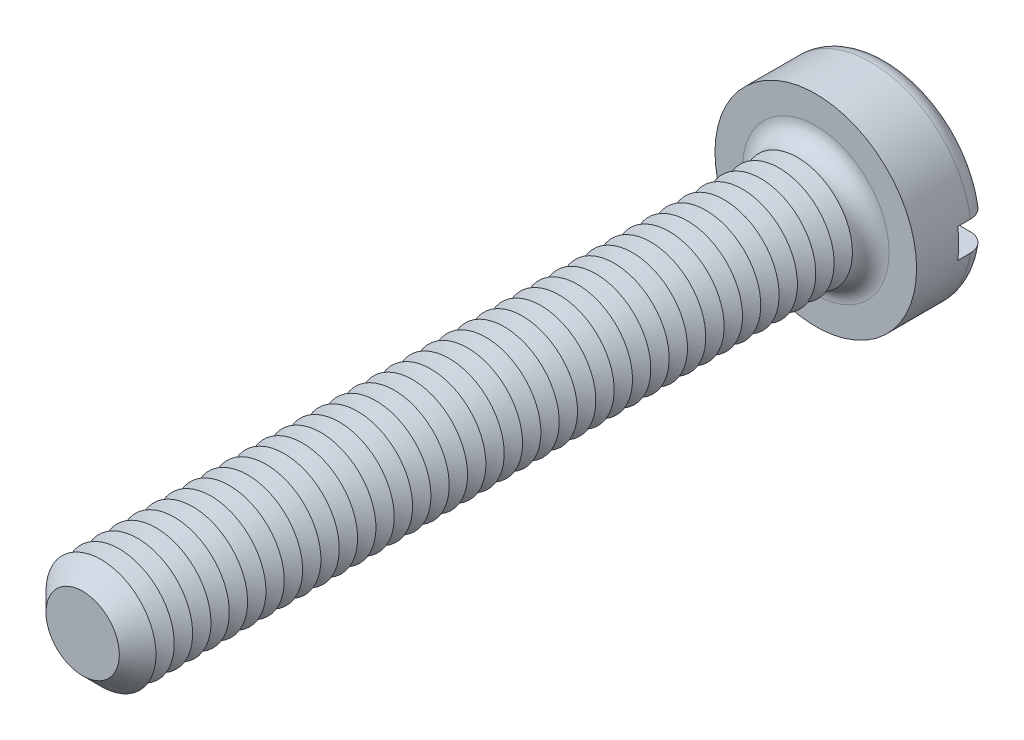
ISO-10303-21;
HEADER;
FILE_DESCRIPTION(('STEP AP214'),'2;1');
FILE_NAME('part.step','',(''),(''),'','','');
FILE_SCHEMA(('AUTOMOTIVE_DESIGN { 1 0 10303 214 1 1 1 1 }'));
ENDSEC;
DATA;
#1=APPLICATION_CONTEXT('core data for automotive mechanical design processes');
#2=APPLICATION_PROTOCOL_DEFINITION('international standard','automotive_design',2000,#1);
#3=PRODUCT_CONTEXT('',#1,'mechanical');
#4=PRODUCT('Part','Part','',(#3));
#5=PRODUCT_RELATED_PRODUCT_CATEGORY('part','',(#4));
#6=PRODUCT_DEFINITION_FORMATION('','',#4);
#7=PRODUCT_DEFINITION_CONTEXT('part definition',#1,'design');
#8=PRODUCT_DEFINITION('design','',#6,#7);
#9=PRODUCT_DEFINITION_SHAPE('','',#8);
#10=(LENGTH_UNIT() NAMED_UNIT(*) SI_UNIT(.MILLI.,.METRE.));
#11=(NAMED_UNIT(*) PLANE_ANGLE_UNIT() SI_UNIT($,.RADIAN.));
#12=(NAMED_UNIT(*) SI_UNIT($,.STERADIAN.) SOLID_ANGLE_UNIT());
#13=UNCERTAINTY_MEASURE_WITH_UNIT(LENGTH_MEASURE(1.E-05),#10,'distance_accuracy_value','');
#14=(GEOMETRIC_REPRESENTATION_CONTEXT(3) GLOBAL_UNCERTAINTY_ASSIGNED_CONTEXT((#13)) GLOBAL_UNIT_ASSIGNED_CONTEXT((#10,
#11,#12)) REPRESENTATION_CONTEXT('',''));
#15=CARTESIAN_POINT('',(0.,0.,0.));
#16=DIRECTION('',(0.,0.,1.));
#17=DIRECTION('',(1.,0.,0.));
#18=AXIS2_PLACEMENT_3D('',#15,#16,#17);
#19=CARTESIAN_POINT('',(0.,0.,-2.));
#20=DIRECTION('',(0.,0.,1.));
#21=DIRECTION('',(1.,0.,0.));
#22=AXIS2_PLACEMENT_3D('',#19,#20,#21);
#23=PLANE('',#22);
#24=CARTESIAN_POINT('',(0.,0.,-2.));
#25=DIRECTION('',(0.,0.,1.));
#26=DIRECTION('',(1.,0.,0.));
#27=AXIS2_PLACEMENT_3D('',#24,#25,#26);
#28=CIRCLE('',#27,2.25);
#29=CARTESIAN_POINT('',(-2.21415898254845,0.4,-2.));
#30=VERTEX_POINT('',#29);
#31=CARTESIAN_POINT('',(2.21415898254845,0.4,-2.));
#32=VERTEX_POINT('',#31);
#33=EDGE_CURVE('E116',#30,#32,#28,.F.);
#34=ORIENTED_EDGE('',*,*,#33,.T.);
#35=DIRECTION('',(1.,0.,0.));
#36=VECTOR('',#35,1.);
#37=CARTESIAN_POINT('',(-2.75,0.400000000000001,-2.));
#38=LINE('',#37,#36);
#39=EDGE_CURVE('E111',#30,#32,#38,.T.);
#40=ORIENTED_EDGE('',*,*,#39,.F.);
#41=EDGE_LOOP('',(#34,#40));
#42=FACE_BOUND('',#41,.T.);
#43=ADVANCED_FACE('F39',(#42),#23,.F.);
#44=CARTESIAN_POINT('',(0.,0.,-1.5));
#45=DIRECTION('',(0.,0.,1.));
#46=DIRECTION('',(1.,0.,0.));
#47=AXIS2_PLACEMENT_3D('',#44,#45,#46);
#48=TOROIDAL_SURFACE('',#47,2.25,0.5);
#49=CARTESIAN_POINT('',(-2.6296588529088,0.400000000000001,-1.78631483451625));
#50=CARTESIAN_POINT('',(-2.61332846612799,0.400000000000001,-1.80942627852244));
#51=CARTESIAN_POINT('',(-2.59501593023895,0.400000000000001,-1.83116426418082));
#52=CARTESIAN_POINT('',(-2.55497423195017,0.400000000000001,-1.87126271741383));
#53=CARTESIAN_POINT('',(-2.53324055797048,0.4,-1.88961865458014));
#54=CARTESIAN_POINT('',(-2.48702796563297,0.4,-1.92241505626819));
#55=CARTESIAN_POINT('',(-2.46255183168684,0.4,-1.93685944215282));
#56=CARTESIAN_POINT('',(-2.41154731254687,0.4,-1.96147315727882));
#57=CARTESIAN_POINT('',(-2.38501943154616,0.4,-1.97164353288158));
#58=CARTESIAN_POINT('',(-2.3303912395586,0.4,-1.98753780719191));
#59=CARTESIAN_POINT('',(-2.30227842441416,0.4,-1.99321871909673));
#60=CARTESIAN_POINT('',(-2.24549884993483,0.4,-1.99984170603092));
#61=CARTESIAN_POINT('',(-2.21683202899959,0.4,-2.00078325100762));
#62=CARTESIAN_POINT('',(-2.15939326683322,0.4,-1.99790249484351));
#63=CARTESIAN_POINT('',(-2.13062419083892,0.4,-1.99402290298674));
#64=CARTESIAN_POINT('',(-2.07413526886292,0.4,-1.98151915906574));
#65=CARTESIAN_POINT('',(-2.04641547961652,0.4,-1.97289475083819));
#66=CARTESIAN_POINT('',(-1.99264697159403,0.4,-1.95107177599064));
#67=CARTESIAN_POINT('',(-1.96660904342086,0.4,-1.93784659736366));
#68=CARTESIAN_POINT('',(-1.91713954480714,0.4,-1.90718730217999));
#69=CARTESIAN_POINT('',(-1.89370795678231,0.4,-1.88975321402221));
#70=CARTESIAN_POINT('',(-1.85029144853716,0.4,-1.85126548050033));
#71=CARTESIAN_POINT('',(-1.83028607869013,0.4,-1.83023492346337));
#72=CARTESIAN_POINT('',(-1.79417432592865,0.4,-1.78505552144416));
#73=CARTESIAN_POINT('',(-1.77806752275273,0.4,-1.76090701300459));
#74=CARTESIAN_POINT('',(-1.75056079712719,0.4,-1.71067721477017));
#75=CARTESIAN_POINT('',(-1.7390748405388,0.4,-1.68464306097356));
#76=CARTESIAN_POINT('',(-1.72075680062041,0.4,-1.63098625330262));
#77=CARTESIAN_POINT('',(-1.71392397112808,0.4,-1.60336385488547));
#78=CARTESIAN_POINT('',(-1.70525661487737,0.4,-1.54801066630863));
#79=CARTESIAN_POINT('',(-1.70330866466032,0.4,-1.52029759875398));
#80=CARTESIAN_POINT('',(-1.70414820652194,0.4,-1.46494458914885));
#81=CARTESIAN_POINT('',(-1.70693532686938,0.4,-1.43730464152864));
#82=CARTESIAN_POINT('',(-1.71709335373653,0.4,-1.38318389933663));
#83=CARTESIAN_POINT('',(-1.72441580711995,0.4,-1.35669397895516));
#84=CARTESIAN_POINT('',(-1.74335830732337,0.4,-1.30529964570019));
#85=CARTESIAN_POINT('',(-1.75497853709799,0.4,-1.2803953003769));
#86=CARTESIAN_POINT('',(-1.78229453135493,0.4,-1.23258298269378));
#87=CARTESIAN_POINT('',(-1.79803217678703,0.4,-1.20969896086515));
#88=CARTESIAN_POINT('',(-1.83304498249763,0.4,-1.16682064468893));
#89=CARTESIAN_POINT('',(-1.85232054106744,0.4,-1.1468266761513));
#90=CARTESIAN_POINT('',(-1.89433695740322,0.4,-1.10980713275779));
#91=CARTESIAN_POINT('',(-1.91714740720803,0.4,-1.09286053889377));
#92=CARTESIAN_POINT('',(-1.96524407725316,0.4,-1.06294809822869));
#93=CARTESIAN_POINT('',(-1.99053056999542,0.4,-1.04998269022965));
#94=CARTESIAN_POINT('',(-2.04340612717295,0.4,-1.02814800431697));
#95=CARTESIAN_POINT('',(-2.07103098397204,0.4,-1.01936532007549));
#96=CARTESIAN_POINT('',(-2.12735840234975,0.4,-1.00652373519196));
#97=CARTESIAN_POINT('',(-2.15606102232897,0.4,-1.00246509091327));
#98=CARTESIAN_POINT('',(-2.21395379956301,0.4,-0.999181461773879));
#99=CARTESIAN_POINT('',(-2.24314598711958,0.4,-0.999992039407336));
#100=CARTESIAN_POINT('',(-2.30097585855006,0.4,-1.00652779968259));
#101=CARTESIAN_POINT('',(-2.32961355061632,0.4,-1.01225290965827));
#102=CARTESIAN_POINT('',(-2.38536238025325,0.4,-1.02843951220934));
#103=CARTESIAN_POINT('',(-2.41248047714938,0.4,-1.03887701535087));
#104=CARTESIAN_POINT('',(-2.46454860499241,0.4,-1.06421009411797));
#105=CARTESIAN_POINT('',(-2.48949875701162,0.4,-1.0791054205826));
#106=CARTESIAN_POINT('',(-2.53620471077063,0.4,-1.11274531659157));
#107=CARTESIAN_POINT('',(-2.55799482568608,0.400000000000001,-1.1314422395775));
#108=CARTESIAN_POINT('',(-2.59807595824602,0.400000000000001,-1.17227176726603));
#109=CARTESIAN_POINT('',(-2.6163672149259,0.400000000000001,-1.19440413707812));
#110=CARTESIAN_POINT('',(-2.64868581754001,0.400000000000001,-1.24117072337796));
#111=CARTESIAN_POINT('',(-2.66276466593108,0.400000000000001,-1.26576935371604));
#112=CARTESIAN_POINT('',(-2.68654482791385,0.400000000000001,-1.31699754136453));
#113=CARTESIAN_POINT('',(-2.69624657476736,0.400000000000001,-1.34362689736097));
#114=CARTESIAN_POINT('',(-2.71090527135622,0.400000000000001,-1.39787706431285));
#115=CARTESIAN_POINT('',(-2.71590826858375,0.400000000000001,-1.4254854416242));
#116=CARTESIAN_POINT('',(-2.72118463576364,0.400000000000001,-1.48115803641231));
#117=CARTESIAN_POINT('',(-2.72145696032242,0.400000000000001,-1.50922235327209));
#118=CARTESIAN_POINT('',(-2.71727180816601,0.400000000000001,-1.56487271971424));
#119=CARTESIAN_POINT('',(-2.71283440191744,0.400000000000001,-1.59246029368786));
#120=CARTESIAN_POINT('',(-2.69939521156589,0.400000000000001,-1.64647499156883));
#121=CARTESIAN_POINT('',(-2.69039909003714,0.400000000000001,-1.67290351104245));
#122=CARTESIAN_POINT('',(-2.67251693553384,0.400000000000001,-1.71382731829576));
#123=CARTESIAN_POINT('',(-2.66497994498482,0.400000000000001,-1.72892686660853));
#124=CARTESIAN_POINT('',(-2.64841616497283,0.400000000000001,-1.75828509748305));
#125=CARTESIAN_POINT('',(-2.63938938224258,0.400000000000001,-1.77254378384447));
#126=CARTESIAN_POINT('',(-2.6296588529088,0.400000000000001,-1.78631483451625));
#127=B_SPLINE_CURVE_WITH_KNOTS('',3,(#49,#50,#51,#52,#53,#54,#55,#56,#57,#58,#59,#60,#61,#62,
#63,#64,#65,#66,#67,#68,#69,#70,#71,#72,#73,#74,#75,#76,#77,#78,#79,#80,#81,#82,#83,#84,#85,#86,
#87,#88,#89,#90,#91,#92,#93,#94,#95,#96,#97,#98,#99,#100,#101,#102,#103,#104,#105,#106,#107,
#108,#109,#110,#111,#112,#113,#114,#115,#116,#117,#118,#119,#120,#121,#122,#123,#124,#125,#126),
.UNSPECIFIED.,.T.,.F.,(4,2,2,2,2,2,2,2,2,2,2,2,2,2,2,2,2,2,2,2,2,2,2,2,2,2,2,2,2,2,2,2,2,2,2,2,
2,2,4),(0.,0.0848338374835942,0.16978050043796,0.254641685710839,0.339482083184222,
0.42512530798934,0.510778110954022,0.597458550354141,0.684143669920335,0.771338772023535,
0.858533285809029,0.945187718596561,1.03183280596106,1.11678035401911,1.20171427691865,
1.28465703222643,1.36759327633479,1.4496584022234,1.53172702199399,1.61466526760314,
1.69761285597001,1.78247103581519,1.86733856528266,1.95389396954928,2.0404540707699,
2.12764713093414,2.21483890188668,2.30159172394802,2.38833969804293,2.4740609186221,
2.55977628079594,2.6443962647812,2.72900787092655,2.81278135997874,2.89657336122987,
2.98000971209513,3.06334267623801,3.113891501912,3.16444009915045),.UNSPECIFIED.);
#128=CARTESIAN_POINT('',(-2.72075357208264,0.400000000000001,-1.50000000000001));
#129=VERTEX_POINT('',#128);
#130=EDGE_CURVE('E482',#129,#30,#127,.T.);
#131=ORIENTED_EDGE('',*,*,#130,.F.);
#132=CARTESIAN_POINT('',(0.,0.,-1.5));
#133=DIRECTION('',(0.,0.,1.));
#134=DIRECTION('',(1.,0.,0.));
#135=AXIS2_PLACEMENT_3D('',#132,#133,#134);
#136=CIRCLE('',#135,2.75);
#137=CARTESIAN_POINT('',(2.7207535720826,0.4,-1.5));
#138=VERTEX_POINT('',#137);
#139=EDGE_CURVE('E125',#138,#129,#136,.T.);
#140=ORIENTED_EDGE('',*,*,#139,.F.);
#141=CARTESIAN_POINT('',(1.7362507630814,0.4,-1.6752840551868));
#142=CARTESIAN_POINT('',(1.74636083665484,0.4,-1.70159961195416));
#143=CARTESIAN_POINT('',(1.7587429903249,0.4,-1.72706707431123));
#144=CARTESIAN_POINT('',(1.78764414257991,0.4,-1.77556609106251));
#145=CARTESIAN_POINT('',(1.80416918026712,0.4,-1.79859401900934));
#146=CARTESIAN_POINT('',(1.84080454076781,0.4,-1.84153587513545));
#147=CARTESIAN_POINT('',(1.86090949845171,0.4,-1.86145438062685));
#148=CARTESIAN_POINT('',(1.9041208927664,0.4,-1.89769607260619));
#149=CARTESIAN_POINT('',(1.92722659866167,0.4,-1.91402013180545));
#150=CARTESIAN_POINT('',(1.97620958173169,0.4,-1.94291288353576));
#151=CARTESIAN_POINT('',(2.00212726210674,0.4,-1.95541309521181));
#152=CARTESIAN_POINT('',(2.05567603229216,0.4,-1.97595143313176));
#153=CARTESIAN_POINT('',(2.08330733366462,0.4,-1.98398900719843));
#154=CARTESIAN_POINT('',(2.13989163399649,0.4,-1.99545904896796));
#155=CARTESIAN_POINT('',(2.16885726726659,0.4,-1.99882930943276));
#156=CARTESIAN_POINT('',(2.22694412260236,0.4,-2.00065872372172));
#157=CARTESIAN_POINT('',(2.25606534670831,0.4,-1.99911781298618));
#158=CARTESIAN_POINT('',(2.31362436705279,0.4,-1.99114818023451));
#159=CARTESIAN_POINT('',(2.34206235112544,0.4,-1.98472081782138));
#160=CARTESIAN_POINT('',(2.39743709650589,0.4,-1.96713601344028));
#161=CARTESIAN_POINT('',(2.42437392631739,0.4,-1.95597878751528));
#162=CARTESIAN_POINT('',(2.47569769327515,0.4,-1.92935960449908));
#163=CARTESIAN_POINT('',(2.50010686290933,0.4,-1.91394052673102));
#164=CARTESIAN_POINT('',(2.54594525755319,0.4,-1.8791725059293));
#165=CARTESIAN_POINT('',(2.56737468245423,0.4,-1.85982382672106));
#166=CARTESIAN_POINT('',(2.60634898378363,0.4,-1.81801641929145));
#167=CARTESIAN_POINT('',(2.6239407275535,0.4,-1.79560138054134));
#168=CARTESIAN_POINT('',(2.65505953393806,0.4,-1.7481077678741));
#169=CARTESIAN_POINT('',(2.66858686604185,0.4,-1.72302937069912));
#170=CARTESIAN_POINT('',(2.69103536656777,0.4,-1.67123055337));
#171=CARTESIAN_POINT('',(2.70000740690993,0.4,-1.64453217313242));
#172=CARTESIAN_POINT('',(2.71330608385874,0.4,-1.59000262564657));
#173=CARTESIAN_POINT('',(2.71763293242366,0.4,-1.5621715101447));
#174=CARTESIAN_POINT('',(2.72149675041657,0.4,-1.50637655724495));
#175=CARTESIAN_POINT('',(2.72106725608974,0.4,-1.47841503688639));
#176=CARTESIAN_POINT('',(2.7155123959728,0.4,-1.42296287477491));
#177=CARTESIAN_POINT('',(2.71038711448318,0.4,-1.39547222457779));
#178=CARTESIAN_POINT('',(2.69560462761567,0.4,-1.34178071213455));
#179=CARTESIAN_POINT('',(2.68595389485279,0.4,-1.31557806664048));
#180=CARTESIAN_POINT('',(2.66240876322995,0.4,-1.26515516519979));
#181=CARTESIAN_POINT('',(2.64851431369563,0.4,-1.24093493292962));
#182=CARTESIAN_POINT('',(2.61681930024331,0.4,-1.19504594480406));
#183=CARTESIAN_POINT('',(2.59900198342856,0.4,-1.17338876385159));
#184=CARTESIAN_POINT('',(2.56001495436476,0.4,-1.13333899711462));
#185=CARTESIAN_POINT('',(2.53884510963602,0.4,-1.11494654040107));
#186=CARTESIAN_POINT('',(2.49354554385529,0.4,-1.08175888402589));
#187=CARTESIAN_POINT('',(2.46938991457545,0.4,-1.06699905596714));
#188=CARTESIAN_POINT('',(2.41896725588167,0.4,-1.04168682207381));
#189=CARTESIAN_POINT('',(2.39270009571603,0.4,-1.03113467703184));
#190=CARTESIAN_POINT('',(2.33844927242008,0.4,-1.01439607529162));
#191=CARTESIAN_POINT('',(2.31044823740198,0.4,-1.00826592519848));
#192=CARTESIAN_POINT('',(2.25381752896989,0.4,-1.00073183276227));
#193=CARTESIAN_POINT('',(2.22518781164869,0.4,-0.999328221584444));
#194=CARTESIAN_POINT('',(2.16774231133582,0.4,-1.00127811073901));
#195=CARTESIAN_POINT('',(2.13892848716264,0.4,-1.00468955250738));
#196=CARTESIAN_POINT('',(2.08227193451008,0.4,-1.01626887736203));
#197=CARTESIAN_POINT('',(2.05442926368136,0.4,-1.02443704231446));
#198=CARTESIAN_POINT('',(2.00032604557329,0.4,-1.04537295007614));
#199=CARTESIAN_POINT('',(1.97407661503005,0.4,-1.05816944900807));
#200=CARTESIAN_POINT('',(1.92411255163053,0.4,-1.08801035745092));
#201=CARTESIAN_POINT('',(1.90039792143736,0.4,-1.10505477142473));
#202=CARTESIAN_POINT('',(1.85633574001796,0.4,-1.14282887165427));
#203=CARTESIAN_POINT('',(1.83597040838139,0.4,-1.16353779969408));
#204=CARTESIAN_POINT('',(1.79908731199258,0.4,-1.20813793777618));
#205=CARTESIAN_POINT('',(1.78256899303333,0.4,-1.23202868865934));
#206=CARTESIAN_POINT('',(1.75420022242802,0.4,-1.28183173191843));
#207=CARTESIAN_POINT('',(1.74226635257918,0.4,-1.30769648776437));
#208=CARTESIAN_POINT('',(1.72302798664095,0.4,-1.36110211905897));
#209=CARTESIAN_POINT('',(1.71572395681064,0.4,-1.38864316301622));
#210=CARTESIAN_POINT('',(1.70611974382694,0.4,-1.44392326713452));
#211=CARTESIAN_POINT('',(1.70370764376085,0.4,-1.47164298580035));
#212=CARTESIAN_POINT('',(1.70363822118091,0.4,-1.52706336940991));
#213=CARTESIAN_POINT('',(1.70597448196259,0.4,-1.55476400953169));
#214=CARTESIAN_POINT('',(1.71335146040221,0.4,-1.59796127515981));
#215=CARTESIAN_POINT('',(1.71686033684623,0.4,-1.61373520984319));
#216=CARTESIAN_POINT('',(1.7254146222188,0.4,-1.64486018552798));
#217=CARTESIAN_POINT('',(1.73045999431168,0.4,-1.66021123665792));
#218=CARTESIAN_POINT('',(1.7362507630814,0.4,-1.6752840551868));
#219=B_SPLINE_CURVE_WITH_KNOTS('',3,(#141,#142,#143,#144,#145,#146,#147,#148,#149,#150,#151,
#152,#153,#154,#155,#156,#157,#158,#159,#160,#161,#162,#163,#164,#165,#166,#167,#168,#169,#170,
#171,#172,#173,#174,#175,#176,#177,#178,#179,#180,#181,#182,#183,#184,#185,#186,#187,#188,#189,
#190,#191,#192,#193,#194,#195,#196,#197,#198,#199,#200,#201,#202,#203,#204,#205,#206,#207,#208,
#209,#210,#211,#212,#213,#214,#215,#216,#217,#218),.UNSPECIFIED.,.T.,.F.,(4,2,2,2,2,2,2,2,2,2,2,
2,2,2,2,2,2,2,2,2,2,2,2,2,2,2,2,2,2,2,2,2,2,2,2,2,2,2,4),(0.,0.0845117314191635,
0.169147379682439,0.253657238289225,0.338146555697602,0.424070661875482,0.510005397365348,
0.597074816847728,0.684145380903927,0.771191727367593,0.858234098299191,0.94443074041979,
1.03062159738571,1.11569223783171,1.20075723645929,1.28485012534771,1.36893917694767,
1.45243570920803,1.53593074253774,1.61930671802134,1.70268368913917,1.7864238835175,
1.87016738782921,1.95469664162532,2.03923113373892,2.12482389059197,2.21042264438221,
2.29706026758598,2.38370302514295,2.47089361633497,2.55808429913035,2.64479602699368,
2.73149525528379,2.81653234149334,2.9015779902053,2.98465497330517,3.06761976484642,
3.11602689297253,3.164432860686),.UNSPECIFIED.);
#220=EDGE_CURVE('E484',#32,#138,#219,.T.);
#221=ORIENTED_EDGE('',*,*,#220,.F.);
#222=ORIENTED_EDGE('',*,*,#33,.F.);
#223=EDGE_LOOP('',(#131,#140,#221,#222));
#224=FACE_BOUND('',#223,.T.);
#225=ADVANCED_FACE('F466',(#224),#48,.T.);
#226=CARTESIAN_POINT('',(0.,0.,-2.));
#227=DIRECTION('',(0.,0.,1.));
#228=DIRECTION('',(1.,0.,0.));
#229=AXIS2_PLACEMENT_3D('',#226,#227,#228);
#230=CYLINDRICAL_SURFACE('',#229,2.75);
#231=DIRECTION('',(0.,0.,1.));
#232=VECTOR('',#231,1.);
#233=CARTESIAN_POINT('',(2.72075357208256,0.4,-2.));
#234=LINE('',#233,#232);
#235=CARTESIAN_POINT('',(2.72075357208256,0.4,-1.15));
#236=VERTEX_POINT('',#235);
#237=EDGE_CURVE('E499',#138,#236,#234,.T.);
#238=ORIENTED_EDGE('',*,*,#237,.F.);
#239=ORIENTED_EDGE('',*,*,#139,.T.);
#240=DIRECTION('',(0.,0.,1.));
#241=VECTOR('',#240,1.);
#242=CARTESIAN_POINT('',(-2.72075357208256,0.4,-2.));
#243=LINE('',#242,#241);
#244=CARTESIAN_POINT('',(-2.72075357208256,0.4,-1.15));
#245=VERTEX_POINT('',#244);
#246=EDGE_CURVE('E63',#245,#129,#243,.F.);
#247=ORIENTED_EDGE('',*,*,#246,.F.);
#248=CARTESIAN_POINT('',(0.,0.,-1.15));
#249=DIRECTION('',(0.,0.,-1.));
#250=DIRECTION('',(-1.,0.,0.));
#251=AXIS2_PLACEMENT_3D('',#248,#249,#250);
#252=CIRCLE('',#251,2.75);
#253=CARTESIAN_POINT('',(-2.72075357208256,-0.4,-1.15));
#254=VERTEX_POINT('',#253);
#255=EDGE_CURVE('E43',#245,#254,#252,.F.);
#256=ORIENTED_EDGE('',*,*,#255,.T.);
#257=DIRECTION('',(0.,0.,1.));
#258=VECTOR('',#257,1.);
#259=CARTESIAN_POINT('',(-2.72075357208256,-0.4,-2.));
#260=LINE('',#259,#258);
#261=CARTESIAN_POINT('',(-2.72075357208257,-0.4,-1.5));
#262=VERTEX_POINT('',#261);
#263=EDGE_CURVE('E496',#262,#254,#260,.T.);
#264=ORIENTED_EDGE('',*,*,#263,.F.);
#265=CARTESIAN_POINT('',(2.72075357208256,-0.4,-1.5));
#266=VERTEX_POINT('',#265);
#267=EDGE_CURVE('E127',#262,#266,#136,.T.);
#268=ORIENTED_EDGE('',*,*,#267,.T.);
#269=DIRECTION('',(0.,0.,1.));
#270=VECTOR('',#269,1.);
#271=CARTESIAN_POINT('',(2.72075357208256,-0.4,-2.));
#272=LINE('',#271,#270);
#273=CARTESIAN_POINT('',(2.72075357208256,-0.4,-1.15));
#274=VERTEX_POINT('',#273);
#275=EDGE_CURVE('E55',#274,#266,#272,.F.);
#276=ORIENTED_EDGE('',*,*,#275,.F.);
#277=EDGE_CURVE('E11',#274,#236,#252,.F.);
#278=ORIENTED_EDGE('',*,*,#277,.T.);
#279=EDGE_LOOP('',(#238,#239,#247,#256,#264,#268,#276,#278));
#280=FACE_BOUND('',#279,.T.);
#281=CARTESIAN_POINT('',(0.,0.,0.));
#282=DIRECTION('',(0.,0.,1.));
#283=DIRECTION('',(1.,0.,0.));
#284=AXIS2_PLACEMENT_3D('',#281,#282,#283);
#285=CIRCLE('',#284,2.75);
#286=CARTESIAN_POINT('',(2.75,0.,0.));
#287=VERTEX_POINT('',#286);
#288=EDGE_CURVE('E502',#287,#287,#285,.T.);
#289=ORIENTED_EDGE('',*,*,#288,.F.);
#290=EDGE_LOOP('',(#289));
#291=FACE_BOUND('',#290,.T.);
#292=ADVANCED_FACE('F462',(#280,#291),#230,.T.);
#293=CARTESIAN_POINT('',(2.21415898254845,-0.4,-2.));
#294=VERTEX_POINT('',#293);
#295=CARTESIAN_POINT('',(-2.21415898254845,-0.4,-2.));
#296=VERTEX_POINT('',#295);
#297=EDGE_CURVE('E109',#294,#296,#28,.F.);
#298=ORIENTED_EDGE('',*,*,#297,.T.);
#299=DIRECTION('',(-1.,0.,0.));
#300=VECTOR('',#299,1.);
#301=CARTESIAN_POINT('',(-2.75,-0.4,-2.));
#302=LINE('',#301,#300);
#303=EDGE_CURVE('E96',#294,#296,#302,.T.);
#304=ORIENTED_EDGE('',*,*,#303,.F.);
#305=EDGE_LOOP('',(#298,#304));
#306=FACE_BOUND('',#305,.T.);
#307=ADVANCED_FACE('F108',(#306),#23,.F.);
#308=CARTESIAN_POINT('',(0.,0.,0.));
#309=DIRECTION('',(0.,0.,1.));
#310=DIRECTION('',(1.,0.,0.));
#311=AXIS2_PLACEMENT_3D('',#308,#309,#310);
#312=PLANE('',#311);
#313=CARTESIAN_POINT('',(0.,0.,0.));
#314=DIRECTION('',(0.,0.,1.));
#315=DIRECTION('',(1.,0.,0.));
#316=AXIS2_PLACEMENT_3D('',#313,#314,#315);
#317=CIRCLE('',#316,2.);
#318=CARTESIAN_POINT('',(2.,0.,0.));
#319=VERTEX_POINT('',#318);
#320=EDGE_CURVE('E115',#319,#319,#317,.F.);
#321=ORIENTED_EDGE('',*,*,#320,.T.);
#322=EDGE_LOOP('',(#321));
#323=FACE_BOUND('',#322,.T.);
#324=ORIENTED_EDGE('',*,*,#288,.T.);
#325=EDGE_LOOP('',(#324));
#326=FACE_BOUND('',#325,.T.);
#327=ADVANCED_FACE('F461',(#323,#326),#312,.T.);
#328=CARTESIAN_POINT('',(-2.6296588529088,-0.4,-1.78631483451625));
#329=CARTESIAN_POINT('',(-2.64575286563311,-0.4,-1.76353353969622));
#330=CARTESIAN_POINT('',(-2.65994473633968,-0.4,-1.73938506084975));
#331=CARTESIAN_POINT('',(-2.68408879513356,-0.4,-1.68903091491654));
#332=CARTESIAN_POINT('',(-2.69403633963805,-0.4,-1.6628230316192));
#333=CARTESIAN_POINT('',(-2.70937899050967,-0.4,-1.60911025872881));
#334=CARTESIAN_POINT('',(-2.71477511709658,-0.4,-1.5816056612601));
#335=CARTESIAN_POINT('',(-2.72085365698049,-0.4,-1.52608718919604));
#336=CARTESIAN_POINT('',(-2.7215371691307,-0.4,-1.49807343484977));
#337=CARTESIAN_POINT('',(-2.71817903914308,-0.4,-1.44242333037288));
#338=CARTESIAN_POINT('',(-2.71415291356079,-0.4,-1.41478604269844));
#339=CARTESIAN_POINT('',(-2.70152104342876,-0.4,-1.36057835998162));
#340=CARTESIAN_POINT('',(-2.69291517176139,-0.4,-1.33400799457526));
#341=CARTESIAN_POINT('',(-2.67137052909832,-0.4,-1.28266198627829));
#342=CARTESIAN_POINT('',(-2.65842829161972,-0.4,-1.25788779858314));
#343=CARTESIAN_POINT('',(-2.62859348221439,-0.4,-1.21084577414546));
#344=CARTESIAN_POINT('',(-2.61170082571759,-0.4,-1.18857799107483));
#345=CARTESIAN_POINT('',(-2.5743351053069,-0.4,-1.1470221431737));
#346=CARTESIAN_POINT('',(-2.55383974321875,-0.4,-1.12775413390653));
#347=CARTESIAN_POINT('',(-2.5099353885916,-0.4,-1.09288845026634));
#348=CARTESIAN_POINT('',(-2.48652625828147,-0.4,-1.07729094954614));
#349=CARTESIAN_POINT('',(-2.43718903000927,-0.4,-1.0500239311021));
#350=CARTESIAN_POINT('',(-2.41123629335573,-0.4,-1.0383990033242));
#351=CARTESIAN_POINT('',(-2.35776417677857,-0.4,-1.01960886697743));
#352=CARTESIAN_POINT('',(-2.33024469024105,-0.4,-1.01244396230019));
#353=CARTESIAN_POINT('',(-2.27404134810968,-0.4,-1.00268156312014));
#354=CARTESIAN_POINT('',(-2.24534705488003,-0.4,-1.00014414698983));
#355=CARTESIAN_POINT('',(-2.18793513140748,-0.4,-0.999867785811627));
#356=CARTESIAN_POINT('',(-2.15921749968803,-0.4,-1.00212917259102));
#357=CARTESIAN_POINT('',(-2.10225052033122,-0.4,-1.01142552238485));
#358=CARTESIAN_POINT('',(-2.07400941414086,-0.4,-1.01851105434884));
#359=CARTESIAN_POINT('',(-2.01911044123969,-0.4,-1.03730994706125));
#360=CARTESIAN_POINT('',(-1.99245264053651,-0.4,-1.04902350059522));
#361=CARTESIAN_POINT('',(-1.94142108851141,-0.4,-1.07679847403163));
#362=CARTESIAN_POINT('',(-1.91705303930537,-0.4,-1.09287038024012));
#363=CARTESIAN_POINT('',(-1.87139758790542,-0.4,-1.12891897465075));
#364=CARTESIAN_POINT('',(-1.85011007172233,-0.4,-1.14889551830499));
#365=CARTESIAN_POINT('',(-1.81149058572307,-0.4,-1.19196940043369));
#366=CARTESIAN_POINT('',(-1.79411779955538,-0.4,-1.21503011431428));
#367=CARTESIAN_POINT('',(-1.76359546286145,-0.4,-1.26379588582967));
#368=CARTESIAN_POINT('',(-1.75044532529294,-0.4,-1.28950057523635));
#369=CARTESIAN_POINT('',(-1.72906221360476,-0.4,-1.3422057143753));
#370=CARTESIAN_POINT('',(-1.72072512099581,-0.4,-1.3691639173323));
#371=CARTESIAN_POINT('',(-1.70880448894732,-0.4,-1.42411084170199));
#372=CARTESIAN_POINT('',(-1.7052202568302,-0.4,-1.45209941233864));
#373=CARTESIAN_POINT('',(-1.70295553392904,-0.4,-1.50768522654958));
#374=CARTESIAN_POINT('',(-1.70417398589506,-0.4,-1.53527840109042));
#375=CARTESIAN_POINT('',(-1.71124536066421,-0.4,-1.58986292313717));
#376=CARTESIAN_POINT('',(-1.71709811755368,-0.4,-1.61685429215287));
#377=CARTESIAN_POINT('',(-1.73321132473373,-0.4,-1.66938107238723));
#378=CARTESIAN_POINT('',(-1.74345625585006,-0.4,-1.69492125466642));
#379=CARTESIAN_POINT('',(-1.76802111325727,-0.4,-1.74395877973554));
#380=CARTESIAN_POINT('',(-1.78234133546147,-0.4,-1.76745597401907));
#381=CARTESIAN_POINT('',(-1.81488631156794,-0.4,-1.81216193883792));
#382=CARTESIAN_POINT('',(-1.83317116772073,-0.4,-1.83332693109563));
#383=CARTESIAN_POINT('',(-1.87296030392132,-0.4,-1.872375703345));
#384=CARTESIAN_POINT('',(-1.89446497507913,-0.4,-1.89025908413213));
#385=CARTESIAN_POINT('',(-1.94063077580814,-0.4,-1.92267732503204));
#386=CARTESIAN_POINT('',(-1.96535444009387,-0.4,-1.93712316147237));
#387=CARTESIAN_POINT('',(-2.01684705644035,-0.4,-1.96173690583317));
#388=CARTESIAN_POINT('',(-2.04361620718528,-0.4,-1.97190439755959));
#389=CARTESIAN_POINT('',(-2.09891021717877,-0.4,-1.9878230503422));
#390=CARTESIAN_POINT('',(-2.12745653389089,-0.4,-1.99349978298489));
#391=CARTESIAN_POINT('',(-2.18509639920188,-0.4,-1.99999556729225));
#392=CARTESIAN_POINT('',(-2.21418994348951,-0.4,-2.00081465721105));
#393=CARTESIAN_POINT('',(-2.27218032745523,-0.4,-1.99755156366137));
#394=CARTESIAN_POINT('',(-2.30107643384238,-0.4,-1.99345627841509));
#395=CARTESIAN_POINT('',(-2.35776697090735,-0.4,-1.98043125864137));
#396=CARTESIAN_POINT('',(-2.38556116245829,-0.4,-1.97150048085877));
#397=CARTESIAN_POINT('',(-2.43901832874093,-0.4,-1.94912081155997));
#398=CARTESIAN_POINT('',(-2.46469578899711,-0.4,-1.93570648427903));
#399=CARTESIAN_POINT('',(-2.51337022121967,-0.4,-1.90471183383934));
#400=CARTESIAN_POINT('',(-2.53637056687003,-0.4,-1.88713684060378));
#401=CARTESIAN_POINT('',(-2.57111030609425,-0.4,-1.85552084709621));
#402=CARTESIAN_POINT('',(-2.58386709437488,-0.4,-1.84257896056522));
#403=CARTESIAN_POINT('',(-2.60790410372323,-0.4,-1.81538935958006));
#404=CARTESIAN_POINT('',(-2.61918433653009,-0.4,-1.80114165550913));
#405=CARTESIAN_POINT('',(-2.6296588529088,-0.4,-1.78631483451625));
#406=B_SPLINE_CURVE_WITH_KNOTS('',3,(#328,#329,#330,#331,#332,#333,#334,#335,#336,#337,#338,
#339,#340,#341,#342,#343,#344,#345,#346,#347,#348,#349,#350,#351,#352,#353,#354,#355,#356,#357,
#358,#359,#360,#361,#362,#363,#364,#365,#366,#367,#368,#369,#370,#371,#372,#373,#374,#375,#376,
#377,#378,#379,#380,#381,#382,#383,#384,#385,#386,#387,#388,#389,#390,#391,#392,#393,#394,#395,
#396,#397,#398,#399,#400,#401,#402,#403,#404,#405),.UNSPECIFIED.,.T.,.F.,(4,2,2,2,2,2,2,2,2,2,2,
2,2,2,2,2,2,2,2,2,2,2,2,2,2,2,2,2,2,2,2,2,2,2,2,2,2,2,4),(0.,0.0836125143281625,
0.167316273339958,0.251001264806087,0.334666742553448,0.418057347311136,0.501450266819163,
0.584910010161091,0.668371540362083,0.752369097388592,0.836370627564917,0.921286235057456,
1.00620762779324,1.09222390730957,1.17824613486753,1.26518425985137,1.35212600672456,
1.43927882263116,1.52642841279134,1.61262232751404,1.69880425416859,1.7830443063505,
1.86727208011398,1.9497371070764,2.03219918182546,2.1143722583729,2.19655130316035,
2.28007615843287,2.36361116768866,2.44911836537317,2.53463387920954,2.62153862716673,
2.70844269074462,2.79557895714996,2.88273403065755,2.96923214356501,3.05562004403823,
3.11003826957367,3.16445606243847),.UNSPECIFIED.);
#407=EDGE_CURVE('E103',#296,#262,#406,.T.);
#408=ORIENTED_EDGE('',*,*,#407,.F.);
#409=ORIENTED_EDGE('',*,*,#297,.F.);
#410=CARTESIAN_POINT('',(1.7362507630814,-0.4,-1.6752840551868));
#411=CARTESIAN_POINT('',(1.72641416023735,-0.4,-1.64967314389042));
#412=CARTESIAN_POINT('',(1.71871480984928,-0.4,-1.62322216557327));
#413=CARTESIAN_POINT('',(1.70786038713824,-0.4,-1.56938399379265));
#414=CARTESIAN_POINT('',(1.70470970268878,-0.4,-1.54199592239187));
#415=CARTESIAN_POINT('',(1.70306971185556,-0.4,-1.48708393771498));
#416=CARTESIAN_POINT('',(1.70457942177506,-0.4,-1.45956005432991));
#417=CARTESIAN_POINT('',(1.71220670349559,-0.4,-1.40516538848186));
#418=CARTESIAN_POINT('',(1.71832341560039,-0.4,-1.3782944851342));
#419=CARTESIAN_POINT('',(1.73494792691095,-0.4,-1.32598312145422));
#420=CARTESIAN_POINT('',(1.74545076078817,-0.4,-1.30054108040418));
#421=CARTESIAN_POINT('',(1.77051013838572,-0.4,-1.25173932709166));
#422=CARTESIAN_POINT('',(1.7850670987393,-0.4,-1.22837982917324));
#423=CARTESIAN_POINT('',(1.81806903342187,-0.4,-1.1839775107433));
#424=CARTESIAN_POINT('',(1.8365752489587,-0.4,-1.16298023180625));
#425=CARTESIAN_POINT('',(1.87677669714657,-0.4,-1.1243010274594));
#426=CARTESIAN_POINT('',(1.89847230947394,-0.4,-1.10661949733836));
#427=CARTESIAN_POINT('',(1.94498854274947,-0.4,-1.07463966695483));
#428=CARTESIAN_POINT('',(1.96987078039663,-0.4,-1.06043095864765));
#429=CARTESIAN_POINT('',(2.02163980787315,-0.4,-1.0363161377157));
#430=CARTESIAN_POINT('',(2.04852678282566,-0.4,-1.02641042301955));
#431=CARTESIAN_POINT('',(2.10400319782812,-0.4,-1.01104128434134));
#432=CARTESIAN_POINT('',(2.13261287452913,-0.4,-1.00565079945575));
#433=CARTESIAN_POINT('',(2.19033179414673,-0.4,-0.999735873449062));
#434=CARTESIAN_POINT('',(2.2194410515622,-0.4,-0.999211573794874));
#435=CARTESIAN_POINT('',(2.27740442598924,-0.4,-1.00306591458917));
#436=CARTESIAN_POINT('',(2.30625777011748,-0.4,-1.00745623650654));
#437=CARTESIAN_POINT('',(2.36280530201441,-0.4,-1.02105937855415));
#438=CARTESIAN_POINT('',(2.39049952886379,-0.4,-1.03027203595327));
#439=CARTESIAN_POINT('',(2.44369359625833,-0.4,-1.05318710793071));
#440=CARTESIAN_POINT('',(2.46920965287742,-0.4,-1.0668518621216));
#441=CARTESIAN_POINT('',(2.51754507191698,-0.4,-1.09832423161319));
#442=CARTESIAN_POINT('',(2.54036461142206,-0.4,-1.11613157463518));
#443=CARTESIAN_POINT('',(2.58234752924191,-0.4,-1.15513986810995));
#444=CARTESIAN_POINT('',(2.601553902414,-0.4,-1.1762945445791));
#445=CARTESIAN_POINT('',(2.63609001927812,-0.4,-1.22156192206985));
#446=CARTESIAN_POINT('',(2.65142002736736,-0.4,-1.24567442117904));
#447=CARTESIAN_POINT('',(2.67757733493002,-0.4,-1.29585881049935));
#448=CARTESIAN_POINT('',(2.68845668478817,-0.4,-1.32190357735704));
#449=CARTESIAN_POINT('',(2.7056478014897,-0.4,-1.375459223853));
#450=CARTESIAN_POINT('',(2.71195980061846,-0.4,-1.40297002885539));
#451=CARTESIAN_POINT('',(2.71979288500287,-0.4,-1.45843707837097));
#452=CARTESIAN_POINT('',(2.72135241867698,-0.4,-1.48638789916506));
#453=CARTESIAN_POINT('',(2.71974298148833,-0.4,-1.54215266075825));
#454=CARTESIAN_POINT('',(2.71657412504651,-0.4,-1.56996660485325));
#455=CARTESIAN_POINT('',(2.70561779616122,-0.4,-1.62459191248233));
#456=CARTESIAN_POINT('',(2.69784258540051,-0.4,-1.65140573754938));
#457=CARTESIAN_POINT('',(2.6779146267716,-0.4,-1.70335337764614));
#458=CARTESIAN_POINT('',(2.66576185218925,-0.4,-1.72848718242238));
#459=CARTESIAN_POINT('',(2.63739107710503,-0.4,-1.77645196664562));
#460=CARTESIAN_POINT('',(2.62116029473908,-0.4,-1.79927538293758));
#461=CARTESIAN_POINT('',(2.58512700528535,-0.4,-1.84190182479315));
#462=CARTESIAN_POINT('',(2.56532438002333,-0.4,-1.86170475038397));
#463=CARTESIAN_POINT('',(2.522535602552,-0.4,-1.89791219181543));
#464=CARTESIAN_POINT('',(2.49952399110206,-0.4,-1.91428661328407));
#465=CARTESIAN_POINT('',(2.45110500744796,-0.4,-1.94299324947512));
#466=CARTESIAN_POINT('',(2.4256974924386,-0.4,-1.95532522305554));
#467=CARTESIAN_POINT('',(2.37288090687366,-0.4,-1.97575769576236));
#468=CARTESIAN_POINT('',(2.34545135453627,-0.4,-1.98380524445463));
#469=CARTESIAN_POINT('',(2.28963821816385,-0.4,-1.99524443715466));
#470=CARTESIAN_POINT('',(2.26125456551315,-0.4,-1.99863574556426));
#471=CARTESIAN_POINT('',(2.20395671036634,-0.4,-2.00070487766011));
#472=CARTESIAN_POINT('',(2.17504033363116,-0.4,-1.99932265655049));
#473=CARTESIAN_POINT('',(2.11784130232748,-0.4,-1.9917648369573));
#474=CARTESIAN_POINT('',(2.08955866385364,-0.4,-1.98558911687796));
#475=CARTESIAN_POINT('',(2.03419451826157,-0.4,-1.96854979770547));
#476=CARTESIAN_POINT('',(2.00712437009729,-0.4,-1.95764925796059));
#477=CARTESIAN_POINT('',(1.95519572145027,-0.4,-1.93144413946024));
#478=CARTESIAN_POINT('',(1.93033780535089,-0.4,-1.91613840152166));
#479=CARTESIAN_POINT('',(1.88362525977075,-0.4,-1.88157419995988));
#480=CARTESIAN_POINT('',(1.86176428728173,-0.4,-1.86232430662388));
#481=CARTESIAN_POINT('',(1.82167218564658,-0.4,-1.82038600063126));
#482=CARTESIAN_POINT('',(1.803436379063,-0.4,-1.7977020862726));
#483=CARTESIAN_POINT('',(1.77700088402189,-0.4,-1.7582526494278));
#484=CARTESIAN_POINT('',(1.7675549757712,-0.4,-1.74230781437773));
#485=CARTESIAN_POINT('',(1.75049861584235,-0.4,-1.70946415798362));
#486=CARTESIAN_POINT('',(1.7428881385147,-0.4,-1.69256534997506));
#487=CARTESIAN_POINT('',(1.7362507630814,-0.4,-1.6752840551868));
#488=B_SPLINE_CURVE_WITH_KNOTS('',3,(#410,#411,#412,#413,#414,#415,#416,#417,#418,#419,#420,
#421,#422,#423,#424,#425,#426,#427,#428,#429,#430,#431,#432,#433,#434,#435,#436,#437,#438,#439,
#440,#441,#442,#443,#444,#445,#446,#447,#448,#449,#450,#451,#452,#453,#454,#455,#456,#457,#458,
#459,#460,#461,#462,#463,#464,#465,#466,#467,#468,#469,#470,#471,#472,#473,#474,#475,#476,#477,
#478,#479,#480,#481,#482,#483,#484,#485,#486,#487),.UNSPECIFIED.,.T.,.F.,(4,2,2,2,2,2,2,2,2,2,2,
2,2,2,2,2,2,2,2,2,2,2,2,2,2,2,2,2,2,2,2,2,2,2,2,2,2,2,4),(0.,0.0822382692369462,
0.164555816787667,0.246855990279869,0.329140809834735,0.411332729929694,0.493533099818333,
0.577115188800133,0.660707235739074,0.746270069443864,0.831840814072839,0.918768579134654,
1.00569887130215,1.09283622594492,1.17997064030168,1.26638632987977,1.35279634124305,
1.43810213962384,1.52340211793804,1.60767384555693,1.69194128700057,1.77552515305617,
1.85910699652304,1.94246734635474,2.02582820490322,2.10945367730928,2.19308191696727,
2.2774160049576,2.36175512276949,2.4471137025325,2.53247843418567,2.61892083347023,
2.70536542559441,2.79249842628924,2.87965437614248,2.96662291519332,3.05347850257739,
3.10897061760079,3.16446195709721),.UNSPECIFIED.);
#489=EDGE_CURVE('E92',#266,#294,#488,.T.);
#490=ORIENTED_EDGE('',*,*,#489,.F.);
#491=ORIENTED_EDGE('',*,*,#267,.F.);
#492=EDGE_LOOP('',(#408,#409,#490,#491));
#493=FACE_BOUND('',#492,.T.);
#494=ADVANCED_FACE('F113',(#493),#48,.T.);
#495=CARTESIAN_POINT('',(0.,0.,0.5));
#496=DIRECTION('',(0.,0.,1.));
#497=DIRECTION('',(1.,0.,0.));
#498=AXIS2_PLACEMENT_3D('',#495,#496,#497);
#499=TOROIDAL_SURFACE('',#498,2.,0.5);
#500=ORIENTED_EDGE('',*,*,#320,.F.);
#501=EDGE_LOOP('',(#500));
#502=FACE_BOUND('',#501,.T.);
#503=CARTESIAN_POINT('',(0.,0.,0.5));
#504=DIRECTION('',(0.,0.,-1.));
#505=DIRECTION('',(-1.,0.,0.));
#506=AXIS2_PLACEMENT_3D('',#503,#504,#505);
#507=CIRCLE('',#506,1.5);
#508=CARTESIAN_POINT('',(-1.5,0.,0.5));
#509=VERTEX_POINT('',#508);
#510=EDGE_CURVE('E508',#509,#509,#507,.T.);
#511=ORIENTED_EDGE('',*,*,#510,.T.);
#512=EDGE_LOOP('',(#511));
#513=FACE_BOUND('',#512,.T.);
#514=ADVANCED_FACE('F454',(#502,#513),#499,.F.);
#515=CARTESIAN_POINT('',(0.,0.,0.750000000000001));
#516=DIRECTION('',(0.,0.,-1.));
#517=DIRECTION('',(-1.,0.,0.));
#518=AXIS2_PLACEMENT_3D('',#515,#516,#517);
#519=CONICAL_SURFACE('',#518,1.06698729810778,1.0471975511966);
#520=ORIENTED_EDGE('',*,*,#510,.F.);
#521=EDGE_LOOP('',(#520));
#522=FACE_BOUND('',#521,.T.);
#523=CARTESIAN_POINT('',(0.,0.,0.750000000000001));
#524=DIRECTION('',(0.,0.,-1.));
#525=DIRECTION('',(-1.,0.,0.));
#526=AXIS2_PLACEMENT_3D('',#523,#524,#525);
#527=CIRCLE('',#526,1.06698729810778);
#528=CARTESIAN_POINT('',(-1.06698729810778,0.,0.750000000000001));
#529=VERTEX_POINT('',#528);
#530=EDGE_CURVE('E514',#529,#529,#527,.T.);
#531=ORIENTED_EDGE('',*,*,#530,.T.);
#532=EDGE_LOOP('',(#531));
#533=FACE_BOUND('',#532,.T.);
#534=ADVANCED_FACE('F450',(#522,#533),#519,.T.);
#535=CARTESIAN_POINT('',(0.,0.,1.));
#536=DIRECTION('',(0.,0.,1.));
#537=DIRECTION('',(1.,0.,0.));
#538=AXIS2_PLACEMENT_3D('',#535,#536,#537);
#539=CONICAL_SURFACE('',#538,1.5,1.0471975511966);
#540=ORIENTED_EDGE('',*,*,#530,.F.);
#541=EDGE_LOOP('',(#540));
#542=FACE_BOUND('',#541,.T.);
#543=CARTESIAN_POINT('',(0.,0.,1.));
#544=DIRECTION('',(0.,0.,-1.));
#545=DIRECTION('',(-1.,0.,0.));
#546=AXIS2_PLACEMENT_3D('',#543,#544,#545);
#547=CIRCLE('',#546,1.5);
#548=CARTESIAN_POINT('',(-1.5,0.,1.));
#549=VERTEX_POINT('',#548);
#550=EDGE_CURVE('E520',#549,#549,#547,.T.);
#551=ORIENTED_EDGE('',*,*,#550,.T.);
#552=EDGE_LOOP('',(#551));
#553=FACE_BOUND('',#552,.T.);
#554=ADVANCED_FACE('F446',(#542,#553),#539,.T.);
#555=CARTESIAN_POINT('',(0.,0.,1.25));
#556=DIRECTION('',(0.,0.,-1.));
#557=DIRECTION('',(-1.,0.,0.));
#558=AXIS2_PLACEMENT_3D('',#555,#556,#557);
#559=CONICAL_SURFACE('',#558,1.06698729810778,1.0471975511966);
#560=ORIENTED_EDGE('',*,*,#550,.F.);
#561=EDGE_LOOP('',(#560));
#562=FACE_BOUND('',#561,.T.);
#563=CARTESIAN_POINT('',(0.,0.,1.25));
#564=DIRECTION('',(0.,0.,-1.));
#565=DIRECTION('',(-1.,0.,0.));
#566=AXIS2_PLACEMENT_3D('',#563,#564,#565);
#567=CIRCLE('',#566,1.06698729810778);
#568=CARTESIAN_POINT('',(-1.06698729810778,0.,1.25));
#569=VERTEX_POINT('',#568);
#570=EDGE_CURVE('E524',#569,#569,#567,.T.);
#571=ORIENTED_EDGE('',*,*,#570,.T.);
#572=EDGE_LOOP('',(#571));
#573=FACE_BOUND('',#572,.T.);
#574=ADVANCED_FACE('F442',(#562,#573),#559,.T.);
#575=CARTESIAN_POINT('',(0.,0.,1.5));
#576=DIRECTION('',(0.,0.,1.));
#577=DIRECTION('',(1.,0.,0.));
#578=AXIS2_PLACEMENT_3D('',#575,#576,#577);
#579=CONICAL_SURFACE('',#578,1.5,1.0471975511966);
#580=ORIENTED_EDGE('',*,*,#570,.F.);
#581=EDGE_LOOP('',(#580));
#582=FACE_BOUND('',#581,.T.);
#583=CARTESIAN_POINT('',(0.,0.,1.5));
#584=DIRECTION('',(0.,0.,-1.));
#585=DIRECTION('',(-1.,0.,0.));
#586=AXIS2_PLACEMENT_3D('',#583,#584,#585);
#587=CIRCLE('',#586,1.5);
#588=CARTESIAN_POINT('',(-1.5,0.,1.5));
#589=VERTEX_POINT('',#588);
#590=EDGE_CURVE('E528',#589,#589,#587,.T.);
#591=ORIENTED_EDGE('',*,*,#590,.T.);
#592=EDGE_LOOP('',(#591));
#593=FACE_BOUND('',#592,.T.);
#594=ADVANCED_FACE('F438',(#582,#593),#579,.T.);
#595=CARTESIAN_POINT('',(0.,0.,1.75));
#596=DIRECTION('',(0.,0.,-1.));
#597=DIRECTION('',(-1.,0.,0.));
#598=AXIS2_PLACEMENT_3D('',#595,#596,#597);
#599=CONICAL_SURFACE('',#598,1.06698729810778,1.0471975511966);
#600=ORIENTED_EDGE('',*,*,#590,.F.);
#601=EDGE_LOOP('',(#600));
#602=FACE_BOUND('',#601,.T.);
#603=CARTESIAN_POINT('',(0.,0.,1.75));
#604=DIRECTION('',(0.,0.,-1.));
#605=DIRECTION('',(-1.,0.,0.));
#606=AXIS2_PLACEMENT_3D('',#603,#604,#605);
#607=CIRCLE('',#606,1.06698729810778);
#608=CARTESIAN_POINT('',(-1.06698729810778,0.,1.75));
#609=VERTEX_POINT('',#608);
#610=EDGE_CURVE('E531',#609,#609,#607,.T.);
#611=ORIENTED_EDGE('',*,*,#610,.T.);
#612=EDGE_LOOP('',(#611));
#613=FACE_BOUND('',#612,.T.);
#614=ADVANCED_FACE('F434',(#602,#613),#599,.T.);
#615=CARTESIAN_POINT('',(0.,0.,2.));
#616=DIRECTION('',(0.,0.,1.));
#617=DIRECTION('',(1.,0.,0.));
#618=AXIS2_PLACEMENT_3D('',#615,#616,#617);
#619=CONICAL_SURFACE('',#618,1.5,1.0471975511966);
#620=ORIENTED_EDGE('',*,*,#610,.F.);
#621=EDGE_LOOP('',(#620));
#622=FACE_BOUND('',#621,.T.);
#623=CARTESIAN_POINT('',(0.,0.,2.));
#624=DIRECTION('',(0.,0.,-1.));
#625=DIRECTION('',(-1.,0.,0.));
#626=AXIS2_PLACEMENT_3D('',#623,#624,#625);
#627=CIRCLE('',#626,1.5);
#628=CARTESIAN_POINT('',(-1.5,0.,2.));
#629=VERTEX_POINT('',#628);
#630=EDGE_CURVE('E535',#629,#629,#627,.T.);
#631=ORIENTED_EDGE('',*,*,#630,.T.);
#632=EDGE_LOOP('',(#631));
#633=FACE_BOUND('',#632,.T.);
#634=ADVANCED_FACE('F430',(#622,#633),#619,.T.);
#635=CARTESIAN_POINT('',(0.,0.,2.25));
#636=DIRECTION('',(0.,0.,-1.));
#637=DIRECTION('',(-1.,0.,0.));
#638=AXIS2_PLACEMENT_3D('',#635,#636,#637);
#639=CONICAL_SURFACE('',#638,1.06698729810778,1.0471975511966);
#640=ORIENTED_EDGE('',*,*,#630,.F.);
#641=EDGE_LOOP('',(#640));
#642=FACE_BOUND('',#641,.T.);
#643=CARTESIAN_POINT('',(0.,0.,2.25));
#644=DIRECTION('',(0.,0.,-1.));
#645=DIRECTION('',(-1.,0.,0.));
#646=AXIS2_PLACEMENT_3D('',#643,#644,#645);
#647=CIRCLE('',#646,1.06698729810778);
#648=CARTESIAN_POINT('',(-1.06698729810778,0.,2.25));
#649=VERTEX_POINT('',#648);
#650=EDGE_CURVE('E538',#649,#649,#647,.T.);
#651=ORIENTED_EDGE('',*,*,#650,.T.);
#652=EDGE_LOOP('',(#651));
#653=FACE_BOUND('',#652,.T.);
#654=ADVANCED_FACE('F426',(#642,#653),#639,.T.);
#655=CARTESIAN_POINT('',(0.,0.,2.5));
#656=DIRECTION('',(0.,0.,1.));
#657=DIRECTION('',(1.,0.,0.));
#658=AXIS2_PLACEMENT_3D('',#655,#656,#657);
#659=CONICAL_SURFACE('',#658,1.5,1.0471975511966);
#660=ORIENTED_EDGE('',*,*,#650,.F.);
#661=EDGE_LOOP('',(#660));
#662=FACE_BOUND('',#661,.T.);
#663=CARTESIAN_POINT('',(0.,0.,2.5));
#664=DIRECTION('',(0.,0.,-1.));
#665=DIRECTION('',(-1.,0.,0.));
#666=AXIS2_PLACEMENT_3D('',#663,#664,#665);
#667=CIRCLE('',#666,1.5);
#668=CARTESIAN_POINT('',(-1.5,0.,2.5));
#669=VERTEX_POINT('',#668);
#670=EDGE_CURVE('E542',#669,#669,#667,.T.);
#671=ORIENTED_EDGE('',*,*,#670,.T.);
#672=EDGE_LOOP('',(#671));
#673=FACE_BOUND('',#672,.T.);
#674=ADVANCED_FACE('F422',(#662,#673),#659,.T.);
#675=CARTESIAN_POINT('',(0.,0.,2.75));
#676=DIRECTION('',(0.,0.,-1.));
#677=DIRECTION('',(-1.,0.,0.));
#678=AXIS2_PLACEMENT_3D('',#675,#676,#677);
#679=CONICAL_SURFACE('',#678,1.06698729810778,1.0471975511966);
#680=ORIENTED_EDGE('',*,*,#670,.F.);
#681=EDGE_LOOP('',(#680));
#682=FACE_BOUND('',#681,.T.);
#683=CARTESIAN_POINT('',(0.,0.,2.75));
#684=DIRECTION('',(0.,0.,-1.));
#685=DIRECTION('',(-1.,0.,0.));
#686=AXIS2_PLACEMENT_3D('',#683,#684,#685);
#687=CIRCLE('',#686,1.06698729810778);
#688=CARTESIAN_POINT('',(-1.06698729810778,0.,2.75));
#689=VERTEX_POINT('',#688);
#690=EDGE_CURVE('E546',#689,#689,#687,.T.);
#691=ORIENTED_EDGE('',*,*,#690,.T.);
#692=EDGE_LOOP('',(#691));
#693=FACE_BOUND('',#692,.T.);
#694=ADVANCED_FACE('F418',(#682,#693),#679,.T.);
#695=CARTESIAN_POINT('',(0.,0.,3.));
#696=DIRECTION('',(0.,0.,1.));
#697=DIRECTION('',(1.,0.,0.));
#698=AXIS2_PLACEMENT_3D('',#695,#696,#697);
#699=CONICAL_SURFACE('',#698,1.5,1.0471975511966);
#700=ORIENTED_EDGE('',*,*,#690,.F.);
#701=EDGE_LOOP('',(#700));
#702=FACE_BOUND('',#701,.T.);
#703=CARTESIAN_POINT('',(0.,0.,3.));
#704=DIRECTION('',(0.,0.,-1.));
#705=DIRECTION('',(-1.,0.,0.));
#706=AXIS2_PLACEMENT_3D('',#703,#704,#705);
#707=CIRCLE('',#706,1.5);
#708=CARTESIAN_POINT('',(-1.5,0.,3.));
#709=VERTEX_POINT('',#708);
#710=EDGE_CURVE('E550',#709,#709,#707,.T.);
#711=ORIENTED_EDGE('',*,*,#710,.T.);
#712=EDGE_LOOP('',(#711));
#713=FACE_BOUND('',#712,.T.);
#714=ADVANCED_FACE('F414',(#702,#713),#699,.T.);
#715=CARTESIAN_POINT('',(0.,0.,3.25));
#716=DIRECTION('',(0.,0.,-1.));
#717=DIRECTION('',(-1.,0.,0.));
#718=AXIS2_PLACEMENT_3D('',#715,#716,#717);
#719=CONICAL_SURFACE('',#718,1.06698729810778,1.0471975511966);
#720=ORIENTED_EDGE('',*,*,#710,.F.);
#721=EDGE_LOOP('',(#720));
#722=FACE_BOUND('',#721,.T.);
#723=CARTESIAN_POINT('',(0.,0.,3.25));
#724=DIRECTION('',(0.,0.,-1.));
#725=DIRECTION('',(-1.,0.,0.));
#726=AXIS2_PLACEMENT_3D('',#723,#724,#725);
#727=CIRCLE('',#726,1.06698729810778);
#728=CARTESIAN_POINT('',(-1.06698729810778,0.,3.25));
#729=VERTEX_POINT('',#728);
#730=EDGE_CURVE('E554',#729,#729,#727,.T.);
#731=ORIENTED_EDGE('',*,*,#730,.T.);
#732=EDGE_LOOP('',(#731));
#733=FACE_BOUND('',#732,.T.);
#734=ADVANCED_FACE('F410',(#722,#733),#719,.T.);
#735=CARTESIAN_POINT('',(0.,0.,3.5));
#736=DIRECTION('',(0.,0.,1.));
#737=DIRECTION('',(1.,0.,0.));
#738=AXIS2_PLACEMENT_3D('',#735,#736,#737);
#739=CONICAL_SURFACE('',#738,1.5,1.0471975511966);
#740=ORIENTED_EDGE('',*,*,#730,.F.);
#741=EDGE_LOOP('',(#740));
#742=FACE_BOUND('',#741,.T.);
#743=CARTESIAN_POINT('',(0.,0.,3.5));
#744=DIRECTION('',(0.,0.,-1.));
#745=DIRECTION('',(-1.,0.,0.));
#746=AXIS2_PLACEMENT_3D('',#743,#744,#745);
#747=CIRCLE('',#746,1.5);
#748=CARTESIAN_POINT('',(-1.5,0.,3.5));
#749=VERTEX_POINT('',#748);
#750=EDGE_CURVE('E558',#749,#749,#747,.T.);
#751=ORIENTED_EDGE('',*,*,#750,.T.);
#752=EDGE_LOOP('',(#751));
#753=FACE_BOUND('',#752,.T.);
#754=ADVANCED_FACE('F406',(#742,#753),#739,.T.);
#755=CARTESIAN_POINT('',(0.,0.,3.75));
#756=DIRECTION('',(0.,0.,-1.));
#757=DIRECTION('',(-1.,0.,0.));
#758=AXIS2_PLACEMENT_3D('',#755,#756,#757);
#759=CONICAL_SURFACE('',#758,1.06698729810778,1.0471975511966);
#760=ORIENTED_EDGE('',*,*,#750,.F.);
#761=EDGE_LOOP('',(#760));
#762=FACE_BOUND('',#761,.T.);
#763=CARTESIAN_POINT('',(0.,0.,3.75));
#764=DIRECTION('',(0.,0.,-1.));
#765=DIRECTION('',(-1.,0.,0.));
#766=AXIS2_PLACEMENT_3D('',#763,#764,#765);
#767=CIRCLE('',#766,1.06698729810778);
#768=CARTESIAN_POINT('',(-1.06698729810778,0.,3.75));
#769=VERTEX_POINT('',#768);
#770=EDGE_CURVE('E562',#769,#769,#767,.T.);
#771=ORIENTED_EDGE('',*,*,#770,.T.);
#772=EDGE_LOOP('',(#771));
#773=FACE_BOUND('',#772,.T.);
#774=ADVANCED_FACE('F402',(#762,#773),#759,.T.);
#775=CARTESIAN_POINT('',(0.,0.,4.));
#776=DIRECTION('',(0.,0.,1.));
#777=DIRECTION('',(1.,0.,0.));
#778=AXIS2_PLACEMENT_3D('',#775,#776,#777);
#779=CONICAL_SURFACE('',#778,1.5,1.0471975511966);
#780=ORIENTED_EDGE('',*,*,#770,.F.);
#781=EDGE_LOOP('',(#780));
#782=FACE_BOUND('',#781,.T.);
#783=CARTESIAN_POINT('',(0.,0.,4.));
#784=DIRECTION('',(0.,0.,-1.));
#785=DIRECTION('',(-1.,0.,0.));
#786=AXIS2_PLACEMENT_3D('',#783,#784,#785);
#787=CIRCLE('',#786,1.5);
#788=CARTESIAN_POINT('',(-1.5,0.,4.));
#789=VERTEX_POINT('',#788);
#790=EDGE_CURVE('E566',#789,#789,#787,.T.);
#791=ORIENTED_EDGE('',*,*,#790,.T.);
#792=EDGE_LOOP('',(#791));
#793=FACE_BOUND('',#792,.T.);
#794=ADVANCED_FACE('F398',(#782,#793),#779,.T.);
#795=CARTESIAN_POINT('',(0.,0.,4.25));
#796=DIRECTION('',(0.,0.,-1.));
#797=DIRECTION('',(-1.,0.,0.));
#798=AXIS2_PLACEMENT_3D('',#795,#796,#797);
#799=CONICAL_SURFACE('',#798,1.06698729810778,1.0471975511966);
#800=ORIENTED_EDGE('',*,*,#790,.F.);
#801=EDGE_LOOP('',(#800));
#802=FACE_BOUND('',#801,.T.);
#803=CARTESIAN_POINT('',(0.,0.,4.25));
#804=DIRECTION('',(0.,0.,-1.));
#805=DIRECTION('',(-1.,0.,0.));
#806=AXIS2_PLACEMENT_3D('',#803,#804,#805);
#807=CIRCLE('',#806,1.06698729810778);
#808=CARTESIAN_POINT('',(-1.06698729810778,0.,4.25));
#809=VERTEX_POINT('',#808);
#810=EDGE_CURVE('E570',#809,#809,#807,.T.);
#811=ORIENTED_EDGE('',*,*,#810,.T.);
#812=EDGE_LOOP('',(#811));
#813=FACE_BOUND('',#812,.T.);
#814=ADVANCED_FACE('F394',(#802,#813),#799,.T.);
#815=CARTESIAN_POINT('',(0.,0.,4.5));
#816=DIRECTION('',(0.,0.,1.));
#817=DIRECTION('',(1.,0.,0.));
#818=AXIS2_PLACEMENT_3D('',#815,#816,#817);
#819=CONICAL_SURFACE('',#818,1.5,1.0471975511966);
#820=ORIENTED_EDGE('',*,*,#810,.F.);
#821=EDGE_LOOP('',(#820));
#822=FACE_BOUND('',#821,.T.);
#823=CARTESIAN_POINT('',(0.,0.,4.5));
#824=DIRECTION('',(0.,0.,-1.));
#825=DIRECTION('',(-1.,0.,0.));
#826=AXIS2_PLACEMENT_3D('',#823,#824,#825);
#827=CIRCLE('',#826,1.5);
#828=CARTESIAN_POINT('',(-1.5,0.,4.5));
#829=VERTEX_POINT('',#828);
#830=EDGE_CURVE('E574',#829,#829,#827,.T.);
#831=ORIENTED_EDGE('',*,*,#830,.T.);
#832=EDGE_LOOP('',(#831));
#833=FACE_BOUND('',#832,.T.);
#834=ADVANCED_FACE('F390',(#822,#833),#819,.T.);
#835=CARTESIAN_POINT('',(0.,0.,4.75));
#836=DIRECTION('',(0.,0.,-1.));
#837=DIRECTION('',(-1.,0.,0.));
#838=AXIS2_PLACEMENT_3D('',#835,#836,#837);
#839=CONICAL_SURFACE('',#838,1.06698729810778,1.0471975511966);
#840=ORIENTED_EDGE('',*,*,#830,.F.);
#841=EDGE_LOOP('',(#840));
#842=FACE_BOUND('',#841,.T.);
#843=CARTESIAN_POINT('',(0.,0.,4.75));
#844=DIRECTION('',(0.,0.,-1.));
#845=DIRECTION('',(-1.,0.,0.));
#846=AXIS2_PLACEMENT_3D('',#843,#844,#845);
#847=CIRCLE('',#846,1.06698729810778);
#848=CARTESIAN_POINT('',(-1.06698729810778,0.,4.75));
#849=VERTEX_POINT('',#848);
#850=EDGE_CURVE('E578',#849,#849,#847,.T.);
#851=ORIENTED_EDGE('',*,*,#850,.T.);
#852=EDGE_LOOP('',(#851));
#853=FACE_BOUND('',#852,.T.);
#854=ADVANCED_FACE('F386',(#842,#853),#839,.T.);
#855=CARTESIAN_POINT('',(0.,0.,5.));
#856=DIRECTION('',(0.,0.,1.));
#857=DIRECTION('',(1.,0.,0.));
#858=AXIS2_PLACEMENT_3D('',#855,#856,#857);
#859=CONICAL_SURFACE('',#858,1.5,1.0471975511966);
#860=ORIENTED_EDGE('',*,*,#850,.F.);
#861=EDGE_LOOP('',(#860));
#862=FACE_BOUND('',#861,.T.);
#863=CARTESIAN_POINT('',(0.,0.,5.));
#864=DIRECTION('',(0.,0.,-1.));
#865=DIRECTION('',(-1.,0.,0.));
#866=AXIS2_PLACEMENT_3D('',#863,#864,#865);
#867=CIRCLE('',#866,1.5);
#868=CARTESIAN_POINT('',(-1.5,0.,5.));
#869=VERTEX_POINT('',#868);
#870=EDGE_CURVE('E582',#869,#869,#867,.T.);
#871=ORIENTED_EDGE('',*,*,#870,.T.);
#872=EDGE_LOOP('',(#871));
#873=FACE_BOUND('',#872,.T.);
#874=ADVANCED_FACE('F382',(#862,#873),#859,.T.);
#875=CARTESIAN_POINT('',(0.,0.,5.25));
#876=DIRECTION('',(0.,0.,-1.));
#877=DIRECTION('',(-1.,0.,0.));
#878=AXIS2_PLACEMENT_3D('',#875,#876,#877);
#879=CONICAL_SURFACE('',#878,1.06698729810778,1.0471975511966);
#880=ORIENTED_EDGE('',*,*,#870,.F.);
#881=EDGE_LOOP('',(#880));
#882=FACE_BOUND('',#881,.T.);
#883=CARTESIAN_POINT('',(0.,0.,5.25));
#884=DIRECTION('',(0.,0.,-1.));
#885=DIRECTION('',(-1.,0.,0.));
#886=AXIS2_PLACEMENT_3D('',#883,#884,#885);
#887=CIRCLE('',#886,1.06698729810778);
#888=CARTESIAN_POINT('',(-1.06698729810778,0.,5.25));
#889=VERTEX_POINT('',#888);
#890=EDGE_CURVE('E586',#889,#889,#887,.T.);
#891=ORIENTED_EDGE('',*,*,#890,.T.);
#892=EDGE_LOOP('',(#891));
#893=FACE_BOUND('',#892,.T.);
#894=ADVANCED_FACE('F378',(#882,#893),#879,.T.);
#895=CARTESIAN_POINT('',(0.,0.,5.5));
#896=DIRECTION('',(0.,0.,1.));
#897=DIRECTION('',(1.,0.,0.));
#898=AXIS2_PLACEMENT_3D('',#895,#896,#897);
#899=CONICAL_SURFACE('',#898,1.5,1.0471975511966);
#900=ORIENTED_EDGE('',*,*,#890,.F.);
#901=EDGE_LOOP('',(#900));
#902=FACE_BOUND('',#901,.T.);
#903=CARTESIAN_POINT('',(0.,0.,5.5));
#904=DIRECTION('',(0.,0.,-1.));
#905=DIRECTION('',(-1.,0.,0.));
#906=AXIS2_PLACEMENT_3D('',#903,#904,#905);
#907=CIRCLE('',#906,1.5);
#908=CARTESIAN_POINT('',(-1.5,0.,5.5));
#909=VERTEX_POINT('',#908);
#910=EDGE_CURVE('E590',#909,#909,#907,.T.);
#911=ORIENTED_EDGE('',*,*,#910,.T.);
#912=EDGE_LOOP('',(#911));
#913=FACE_BOUND('',#912,.T.);
#914=ADVANCED_FACE('F374',(#902,#913),#899,.T.);
#915=CARTESIAN_POINT('',(0.,0.,5.75));
#916=DIRECTION('',(0.,0.,-1.));
#917=DIRECTION('',(-1.,0.,0.));
#918=AXIS2_PLACEMENT_3D('',#915,#916,#917);
#919=CONICAL_SURFACE('',#918,1.06698729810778,1.0471975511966);
#920=ORIENTED_EDGE('',*,*,#910,.F.);
#921=EDGE_LOOP('',(#920));
#922=FACE_BOUND('',#921,.T.);
#923=CARTESIAN_POINT('',(0.,0.,5.75));
#924=DIRECTION('',(0.,0.,-1.));
#925=DIRECTION('',(-1.,0.,0.));
#926=AXIS2_PLACEMENT_3D('',#923,#924,#925);
#927=CIRCLE('',#926,1.06698729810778);
#928=CARTESIAN_POINT('',(-1.06698729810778,0.,5.75));
#929=VERTEX_POINT('',#928);
#930=EDGE_CURVE('E594',#929,#929,#927,.T.);
#931=ORIENTED_EDGE('',*,*,#930,.T.);
#932=EDGE_LOOP('',(#931));
#933=FACE_BOUND('',#932,.T.);
#934=ADVANCED_FACE('F370',(#922,#933),#919,.T.);
#935=CARTESIAN_POINT('',(0.,0.,6.));
#936=DIRECTION('',(0.,0.,1.));
#937=DIRECTION('',(1.,0.,0.));
#938=AXIS2_PLACEMENT_3D('',#935,#936,#937);
#939=CONICAL_SURFACE('',#938,1.5,1.0471975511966);
#940=ORIENTED_EDGE('',*,*,#930,.F.);
#941=EDGE_LOOP('',(#940));
#942=FACE_BOUND('',#941,.T.);
#943=CARTESIAN_POINT('',(0.,0.,6.));
#944=DIRECTION('',(0.,0.,-1.));
#945=DIRECTION('',(-1.,0.,0.));
#946=AXIS2_PLACEMENT_3D('',#943,#944,#945);
#947=CIRCLE('',#946,1.5);
#948=CARTESIAN_POINT('',(-1.5,0.,6.));
#949=VERTEX_POINT('',#948);
#950=EDGE_CURVE('E598',#949,#949,#947,.T.);
#951=ORIENTED_EDGE('',*,*,#950,.T.);
#952=EDGE_LOOP('',(#951));
#953=FACE_BOUND('',#952,.T.);
#954=ADVANCED_FACE('F366',(#942,#953),#939,.T.);
#955=CARTESIAN_POINT('',(0.,0.,6.25));
#956=DIRECTION('',(0.,0.,-1.));
#957=DIRECTION('',(-1.,0.,0.));
#958=AXIS2_PLACEMENT_3D('',#955,#956,#957);
#959=CONICAL_SURFACE('',#958,1.06698729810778,1.0471975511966);
#960=ORIENTED_EDGE('',*,*,#950,.F.);
#961=EDGE_LOOP('',(#960));
#962=FACE_BOUND('',#961,.T.);
#963=CARTESIAN_POINT('',(0.,0.,6.25));
#964=DIRECTION('',(0.,0.,-1.));
#965=DIRECTION('',(-1.,0.,0.));
#966=AXIS2_PLACEMENT_3D('',#963,#964,#965);
#967=CIRCLE('',#966,1.06698729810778);
#968=CARTESIAN_POINT('',(-1.06698729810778,0.,6.25));
#969=VERTEX_POINT('',#968);
#970=EDGE_CURVE('E602',#969,#969,#967,.T.);
#971=ORIENTED_EDGE('',*,*,#970,.T.);
#972=EDGE_LOOP('',(#971));
#973=FACE_BOUND('',#972,.T.);
#974=ADVANCED_FACE('F362',(#962,#973),#959,.T.);
#975=CARTESIAN_POINT('',(0.,0.,6.5));
#976=DIRECTION('',(0.,0.,1.));
#977=DIRECTION('',(1.,0.,0.));
#978=AXIS2_PLACEMENT_3D('',#975,#976,#977);
#979=CONICAL_SURFACE('',#978,1.5,1.0471975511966);
#980=ORIENTED_EDGE('',*,*,#970,.F.);
#981=EDGE_LOOP('',(#980));
#982=FACE_BOUND('',#981,.T.);
#983=CARTESIAN_POINT('',(0.,0.,6.5));
#984=DIRECTION('',(0.,0.,-1.));
#985=DIRECTION('',(-1.,0.,0.));
#986=AXIS2_PLACEMENT_3D('',#983,#984,#985);
#987=CIRCLE('',#986,1.5);
#988=CARTESIAN_POINT('',(-1.5,0.,6.5));
#989=VERTEX_POINT('',#988);
#990=EDGE_CURVE('E606',#989,#989,#987,.T.);
#991=ORIENTED_EDGE('',*,*,#990,.T.);
#992=EDGE_LOOP('',(#991));
#993=FACE_BOUND('',#992,.T.);
#994=ADVANCED_FACE('F358',(#982,#993),#979,.T.);
#995=CARTESIAN_POINT('',(0.,0.,6.75));
#996=DIRECTION('',(0.,0.,-1.));
#997=DIRECTION('',(-1.,0.,0.));
#998=AXIS2_PLACEMENT_3D('',#995,#996,#997);
#999=CONICAL_SURFACE('',#998,1.06698729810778,1.0471975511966);
#1000=ORIENTED_EDGE('',*,*,#990,.F.);
#1001=EDGE_LOOP('',(#1000));
#1002=FACE_BOUND('',#1001,.T.);
#1003=CARTESIAN_POINT('',(0.,0.,6.75));
#1004=DIRECTION('',(0.,0.,-1.));
#1005=DIRECTION('',(-1.,0.,0.));
#1006=AXIS2_PLACEMENT_3D('',#1003,#1004,#1005);
#1007=CIRCLE('',#1006,1.06698729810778);
#1008=CARTESIAN_POINT('',(-1.06698729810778,0.,6.75));
#1009=VERTEX_POINT('',#1008);
#1010=EDGE_CURVE('E610',#1009,#1009,#1007,.T.);
#1011=ORIENTED_EDGE('',*,*,#1010,.T.);
#1012=EDGE_LOOP('',(#1011));
#1013=FACE_BOUND('',#1012,.T.);
#1014=ADVANCED_FACE('F354',(#1002,#1013),#999,.T.);
#1015=CARTESIAN_POINT('',(0.,0.,7.));
#1016=DIRECTION('',(0.,0.,1.));
#1017=DIRECTION('',(1.,0.,0.));
#1018=AXIS2_PLACEMENT_3D('',#1015,#1016,#1017);
#1019=CONICAL_SURFACE('',#1018,1.5,1.0471975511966);
#1020=ORIENTED_EDGE('',*,*,#1010,.F.);
#1021=EDGE_LOOP('',(#1020));
#1022=FACE_BOUND('',#1021,.T.);
#1023=CARTESIAN_POINT('',(0.,0.,7.));
#1024=DIRECTION('',(0.,0.,-1.));
#1025=DIRECTION('',(-1.,0.,0.));
#1026=AXIS2_PLACEMENT_3D('',#1023,#1024,#1025);
#1027=CIRCLE('',#1026,1.5);
#1028=CARTESIAN_POINT('',(-1.5,0.,7.));
#1029=VERTEX_POINT('',#1028);
#1030=EDGE_CURVE('E614',#1029,#1029,#1027,.T.);
#1031=ORIENTED_EDGE('',*,*,#1030,.T.);
#1032=EDGE_LOOP('',(#1031));
#1033=FACE_BOUND('',#1032,.T.);
#1034=ADVANCED_FACE('F350',(#1022,#1033),#1019,.T.);
#1035=CARTESIAN_POINT('',(0.,0.,7.25));
#1036=DIRECTION('',(0.,0.,-1.));
#1037=DIRECTION('',(-1.,0.,0.));
#1038=AXIS2_PLACEMENT_3D('',#1035,#1036,#1037);
#1039=CONICAL_SURFACE('',#1038,1.06698729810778,1.0471975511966);
#1040=ORIENTED_EDGE('',*,*,#1030,.F.);
#1041=EDGE_LOOP('',(#1040));
#1042=FACE_BOUND('',#1041,.T.);
#1043=CARTESIAN_POINT('',(0.,0.,7.25));
#1044=DIRECTION('',(0.,0.,-1.));
#1045=DIRECTION('',(-1.,0.,0.));
#1046=AXIS2_PLACEMENT_3D('',#1043,#1044,#1045);
#1047=CIRCLE('',#1046,1.06698729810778);
#1048=CARTESIAN_POINT('',(-1.06698729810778,0.,7.25));
#1049=VERTEX_POINT('',#1048);
#1050=EDGE_CURVE('E618',#1049,#1049,#1047,.T.);
#1051=ORIENTED_EDGE('',*,*,#1050,.T.);
#1052=EDGE_LOOP('',(#1051));
#1053=FACE_BOUND('',#1052,.T.);
#1054=ADVANCED_FACE('F346',(#1042,#1053),#1039,.T.);
#1055=CARTESIAN_POINT('',(0.,0.,7.5));
#1056=DIRECTION('',(0.,0.,1.));
#1057=DIRECTION('',(1.,0.,0.));
#1058=AXIS2_PLACEMENT_3D('',#1055,#1056,#1057);
#1059=CONICAL_SURFACE('',#1058,1.5,1.0471975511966);
#1060=ORIENTED_EDGE('',*,*,#1050,.F.);
#1061=EDGE_LOOP('',(#1060));
#1062=FACE_BOUND('',#1061,.T.);
#1063=CARTESIAN_POINT('',(0.,0.,7.5));
#1064=DIRECTION('',(0.,0.,-1.));
#1065=DIRECTION('',(-1.,0.,0.));
#1066=AXIS2_PLACEMENT_3D('',#1063,#1064,#1065);
#1067=CIRCLE('',#1066,1.5);
#1068=CARTESIAN_POINT('',(-1.5,0.,7.5));
#1069=VERTEX_POINT('',#1068);
#1070=EDGE_CURVE('E622',#1069,#1069,#1067,.T.);
#1071=ORIENTED_EDGE('',*,*,#1070,.T.);
#1072=EDGE_LOOP('',(#1071));
#1073=FACE_BOUND('',#1072,.T.);
#1074=ADVANCED_FACE('F342',(#1062,#1073),#1059,.T.);
#1075=CARTESIAN_POINT('',(0.,0.,7.75));
#1076=DIRECTION('',(0.,0.,-1.));
#1077=DIRECTION('',(-1.,0.,0.));
#1078=AXIS2_PLACEMENT_3D('',#1075,#1076,#1077);
#1079=CONICAL_SURFACE('',#1078,1.06698729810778,1.0471975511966);
#1080=ORIENTED_EDGE('',*,*,#1070,.F.);
#1081=EDGE_LOOP('',(#1080));
#1082=FACE_BOUND('',#1081,.T.);
#1083=CARTESIAN_POINT('',(0.,0.,7.75));
#1084=DIRECTION('',(0.,0.,-1.));
#1085=DIRECTION('',(-1.,0.,0.));
#1086=AXIS2_PLACEMENT_3D('',#1083,#1084,#1085);
#1087=CIRCLE('',#1086,1.06698729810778);
#1088=CARTESIAN_POINT('',(-1.06698729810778,0.,7.75));
#1089=VERTEX_POINT('',#1088);
#1090=EDGE_CURVE('E626',#1089,#1089,#1087,.T.);
#1091=ORIENTED_EDGE('',*,*,#1090,.T.);
#1092=EDGE_LOOP('',(#1091));
#1093=FACE_BOUND('',#1092,.T.);
#1094=ADVANCED_FACE('F338',(#1082,#1093),#1079,.T.);
#1095=CARTESIAN_POINT('',(0.,0.,8.));
#1096=DIRECTION('',(0.,0.,1.));
#1097=DIRECTION('',(1.,0.,0.));
#1098=AXIS2_PLACEMENT_3D('',#1095,#1096,#1097);
#1099=CONICAL_SURFACE('',#1098,1.5,1.0471975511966);
#1100=ORIENTED_EDGE('',*,*,#1090,.F.);
#1101=EDGE_LOOP('',(#1100));
#1102=FACE_BOUND('',#1101,.T.);
#1103=CARTESIAN_POINT('',(0.,0.,8.));
#1104=DIRECTION('',(0.,0.,-1.));
#1105=DIRECTION('',(-1.,0.,0.));
#1106=AXIS2_PLACEMENT_3D('',#1103,#1104,#1105);
#1107=CIRCLE('',#1106,1.5);
#1108=CARTESIAN_POINT('',(-1.5,0.,8.));
#1109=VERTEX_POINT('',#1108);
#1110=EDGE_CURVE('E629',#1109,#1109,#1107,.T.);
#1111=ORIENTED_EDGE('',*,*,#1110,.T.);
#1112=EDGE_LOOP('',(#1111));
#1113=FACE_BOUND('',#1112,.T.);
#1114=ADVANCED_FACE('F334',(#1102,#1113),#1099,.T.);
#1115=CARTESIAN_POINT('',(0.,0.,8.25));
#1116=DIRECTION('',(0.,0.,-1.));
#1117=DIRECTION('',(-1.,0.,0.));
#1118=AXIS2_PLACEMENT_3D('',#1115,#1116,#1117);
#1119=CONICAL_SURFACE('',#1118,1.06698729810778,1.0471975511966);
#1120=ORIENTED_EDGE('',*,*,#1110,.F.);
#1121=EDGE_LOOP('',(#1120));
#1122=FACE_BOUND('',#1121,.T.);
#1123=CARTESIAN_POINT('',(0.,0.,8.25));
#1124=DIRECTION('',(0.,0.,-1.));
#1125=DIRECTION('',(-1.,0.,0.));
#1126=AXIS2_PLACEMENT_3D('',#1123,#1124,#1125);
#1127=CIRCLE('',#1126,1.06698729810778);
#1128=CARTESIAN_POINT('',(-1.06698729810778,0.,8.25));
#1129=VERTEX_POINT('',#1128);
#1130=EDGE_CURVE('E633',#1129,#1129,#1127,.T.);
#1131=ORIENTED_EDGE('',*,*,#1130,.T.);
#1132=EDGE_LOOP('',(#1131));
#1133=FACE_BOUND('',#1132,.T.);
#1134=ADVANCED_FACE('F330',(#1122,#1133),#1119,.T.);
#1135=CARTESIAN_POINT('',(0.,0.,8.5));
#1136=DIRECTION('',(0.,0.,1.));
#1137=DIRECTION('',(1.,0.,0.));
#1138=AXIS2_PLACEMENT_3D('',#1135,#1136,#1137);
#1139=CONICAL_SURFACE('',#1138,1.5,1.0471975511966);
#1140=ORIENTED_EDGE('',*,*,#1130,.F.);
#1141=EDGE_LOOP('',(#1140));
#1142=FACE_BOUND('',#1141,.T.);
#1143=CARTESIAN_POINT('',(0.,0.,8.5));
#1144=DIRECTION('',(0.,0.,-1.));
#1145=DIRECTION('',(-1.,0.,0.));
#1146=AXIS2_PLACEMENT_3D('',#1143,#1144,#1145);
#1147=CIRCLE('',#1146,1.5);
#1148=CARTESIAN_POINT('',(-1.5,0.,8.5));
#1149=VERTEX_POINT('',#1148);
#1150=EDGE_CURVE('E637',#1149,#1149,#1147,.T.);
#1151=ORIENTED_EDGE('',*,*,#1150,.T.);
#1152=EDGE_LOOP('',(#1151));
#1153=FACE_BOUND('',#1152,.T.);
#1154=ADVANCED_FACE('F326',(#1142,#1153),#1139,.T.);
#1155=CARTESIAN_POINT('',(0.,0.,8.75));
#1156=DIRECTION('',(0.,0.,-1.));
#1157=DIRECTION('',(-1.,0.,0.));
#1158=AXIS2_PLACEMENT_3D('',#1155,#1156,#1157);
#1159=CONICAL_SURFACE('',#1158,1.06698729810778,1.0471975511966);
#1160=ORIENTED_EDGE('',*,*,#1150,.F.);
#1161=EDGE_LOOP('',(#1160));
#1162=FACE_BOUND('',#1161,.T.);
#1163=CARTESIAN_POINT('',(0.,0.,8.75));
#1164=DIRECTION('',(0.,0.,-1.));
#1165=DIRECTION('',(-1.,0.,0.));
#1166=AXIS2_PLACEMENT_3D('',#1163,#1164,#1165);
#1167=CIRCLE('',#1166,1.06698729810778);
#1168=CARTESIAN_POINT('',(-1.06698729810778,0.,8.75));
#1169=VERTEX_POINT('',#1168);
#1170=EDGE_CURVE('E641',#1169,#1169,#1167,.T.);
#1171=ORIENTED_EDGE('',*,*,#1170,.T.);
#1172=EDGE_LOOP('',(#1171));
#1173=FACE_BOUND('',#1172,.T.);
#1174=ADVANCED_FACE('F322',(#1162,#1173),#1159,.T.);
#1175=CARTESIAN_POINT('',(0.,0.,9.));
#1176=DIRECTION('',(0.,0.,1.));
#1177=DIRECTION('',(1.,0.,0.));
#1178=AXIS2_PLACEMENT_3D('',#1175,#1176,#1177);
#1179=CONICAL_SURFACE('',#1178,1.5,1.0471975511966);
#1180=ORIENTED_EDGE('',*,*,#1170,.F.);
#1181=EDGE_LOOP('',(#1180));
#1182=FACE_BOUND('',#1181,.T.);
#1183=CARTESIAN_POINT('',(0.,0.,9.));
#1184=DIRECTION('',(0.,0.,-1.));
#1185=DIRECTION('',(-1.,0.,0.));
#1186=AXIS2_PLACEMENT_3D('',#1183,#1184,#1185);
#1187=CIRCLE('',#1186,1.5);
#1188=CARTESIAN_POINT('',(-1.5,0.,9.));
#1189=VERTEX_POINT('',#1188);
#1190=EDGE_CURVE('E645',#1189,#1189,#1187,.T.);
#1191=ORIENTED_EDGE('',*,*,#1190,.T.);
#1192=EDGE_LOOP('',(#1191));
#1193=FACE_BOUND('',#1192,.T.);
#1194=ADVANCED_FACE('F318',(#1182,#1193),#1179,.T.);
#1195=CARTESIAN_POINT('',(0.,0.,9.25));
#1196=DIRECTION('',(0.,0.,-1.));
#1197=DIRECTION('',(-1.,0.,0.));
#1198=AXIS2_PLACEMENT_3D('',#1195,#1196,#1197);
#1199=CONICAL_SURFACE('',#1198,1.06698729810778,1.0471975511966);
#1200=ORIENTED_EDGE('',*,*,#1190,.F.);
#1201=EDGE_LOOP('',(#1200));
#1202=FACE_BOUND('',#1201,.T.);
#1203=CARTESIAN_POINT('',(0.,0.,9.25));
#1204=DIRECTION('',(0.,0.,-1.));
#1205=DIRECTION('',(-1.,0.,0.));
#1206=AXIS2_PLACEMENT_3D('',#1203,#1204,#1205);
#1207=CIRCLE('',#1206,1.06698729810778);
#1208=CARTESIAN_POINT('',(-1.06698729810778,0.,9.25));
#1209=VERTEX_POINT('',#1208);
#1210=EDGE_CURVE('E649',#1209,#1209,#1207,.T.);
#1211=ORIENTED_EDGE('',*,*,#1210,.T.);
#1212=EDGE_LOOP('',(#1211));
#1213=FACE_BOUND('',#1212,.T.);
#1214=ADVANCED_FACE('F314',(#1202,#1213),#1199,.T.);
#1215=CARTESIAN_POINT('',(0.,0.,9.5));
#1216=DIRECTION('',(0.,0.,1.));
#1217=DIRECTION('',(1.,0.,0.));
#1218=AXIS2_PLACEMENT_3D('',#1215,#1216,#1217);
#1219=CONICAL_SURFACE('',#1218,1.5,1.0471975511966);
#1220=ORIENTED_EDGE('',*,*,#1210,.F.);
#1221=EDGE_LOOP('',(#1220));
#1222=FACE_BOUND('',#1221,.T.);
#1223=CARTESIAN_POINT('',(0.,0.,9.5));
#1224=DIRECTION('',(0.,0.,-1.));
#1225=DIRECTION('',(-1.,0.,0.));
#1226=AXIS2_PLACEMENT_3D('',#1223,#1224,#1225);
#1227=CIRCLE('',#1226,1.5);
#1228=CARTESIAN_POINT('',(-1.5,0.,9.5));
#1229=VERTEX_POINT('',#1228);
#1230=EDGE_CURVE('E653',#1229,#1229,#1227,.T.);
#1231=ORIENTED_EDGE('',*,*,#1230,.T.);
#1232=EDGE_LOOP('',(#1231));
#1233=FACE_BOUND('',#1232,.T.);
#1234=ADVANCED_FACE('F310',(#1222,#1233),#1219,.T.);
#1235=CARTESIAN_POINT('',(0.,0.,9.75));
#1236=DIRECTION('',(0.,0.,-1.));
#1237=DIRECTION('',(-1.,0.,0.));
#1238=AXIS2_PLACEMENT_3D('',#1235,#1236,#1237);
#1239=CONICAL_SURFACE('',#1238,1.06698729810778,1.0471975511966);
#1240=ORIENTED_EDGE('',*,*,#1230,.F.);
#1241=EDGE_LOOP('',(#1240));
#1242=FACE_BOUND('',#1241,.T.);
#1243=CARTESIAN_POINT('',(0.,0.,9.75));
#1244=DIRECTION('',(0.,0.,-1.));
#1245=DIRECTION('',(-1.,0.,0.));
#1246=AXIS2_PLACEMENT_3D('',#1243,#1244,#1245);
#1247=CIRCLE('',#1246,1.06698729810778);
#1248=CARTESIAN_POINT('',(-1.06698729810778,0.,9.75));
#1249=VERTEX_POINT('',#1248);
#1250=EDGE_CURVE('E657',#1249,#1249,#1247,.T.);
#1251=ORIENTED_EDGE('',*,*,#1250,.T.);
#1252=EDGE_LOOP('',(#1251));
#1253=FACE_BOUND('',#1252,.T.);
#1254=ADVANCED_FACE('F306',(#1242,#1253),#1239,.T.);
#1255=CARTESIAN_POINT('',(0.,0.,10.));
#1256=DIRECTION('',(0.,0.,1.));
#1257=DIRECTION('',(1.,0.,0.));
#1258=AXIS2_PLACEMENT_3D('',#1255,#1256,#1257);
#1259=CONICAL_SURFACE('',#1258,1.5,1.0471975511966);
#1260=ORIENTED_EDGE('',*,*,#1250,.F.);
#1261=EDGE_LOOP('',(#1260));
#1262=FACE_BOUND('',#1261,.T.);
#1263=CARTESIAN_POINT('',(0.,0.,10.));
#1264=DIRECTION('',(0.,0.,-1.));
#1265=DIRECTION('',(-1.,0.,0.));
#1266=AXIS2_PLACEMENT_3D('',#1263,#1264,#1265);
#1267=CIRCLE('',#1266,1.5);
#1268=CARTESIAN_POINT('',(-1.5,0.,10.));
#1269=VERTEX_POINT('',#1268);
#1270=EDGE_CURVE('E661',#1269,#1269,#1267,.T.);
#1271=ORIENTED_EDGE('',*,*,#1270,.T.);
#1272=EDGE_LOOP('',(#1271));
#1273=FACE_BOUND('',#1272,.T.);
#1274=ADVANCED_FACE('F302',(#1262,#1273),#1259,.T.);
#1275=CARTESIAN_POINT('',(0.,0.,10.25));
#1276=DIRECTION('',(0.,0.,-1.));
#1277=DIRECTION('',(-1.,0.,0.));
#1278=AXIS2_PLACEMENT_3D('',#1275,#1276,#1277);
#1279=CONICAL_SURFACE('',#1278,1.06698729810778,1.0471975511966);
#1280=ORIENTED_EDGE('',*,*,#1270,.F.);
#1281=EDGE_LOOP('',(#1280));
#1282=FACE_BOUND('',#1281,.T.);
#1283=CARTESIAN_POINT('',(0.,0.,10.25));
#1284=DIRECTION('',(0.,0.,-1.));
#1285=DIRECTION('',(-1.,0.,0.));
#1286=AXIS2_PLACEMENT_3D('',#1283,#1284,#1285);
#1287=CIRCLE('',#1286,1.06698729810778);
#1288=CARTESIAN_POINT('',(-1.06698729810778,0.,10.25));
#1289=VERTEX_POINT('',#1288);
#1290=EDGE_CURVE('E665',#1289,#1289,#1287,.T.);
#1291=ORIENTED_EDGE('',*,*,#1290,.T.);
#1292=EDGE_LOOP('',(#1291));
#1293=FACE_BOUND('',#1292,.T.);
#1294=ADVANCED_FACE('F298',(#1282,#1293),#1279,.T.);
#1295=CARTESIAN_POINT('',(0.,0.,10.5));
#1296=DIRECTION('',(0.,0.,1.));
#1297=DIRECTION('',(1.,0.,0.));
#1298=AXIS2_PLACEMENT_3D('',#1295,#1296,#1297);
#1299=CONICAL_SURFACE('',#1298,1.5,1.0471975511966);
#1300=ORIENTED_EDGE('',*,*,#1290,.F.);
#1301=EDGE_LOOP('',(#1300));
#1302=FACE_BOUND('',#1301,.T.);
#1303=CARTESIAN_POINT('',(0.,0.,10.5));
#1304=DIRECTION('',(0.,0.,-1.));
#1305=DIRECTION('',(-1.,0.,0.));
#1306=AXIS2_PLACEMENT_3D('',#1303,#1304,#1305);
#1307=CIRCLE('',#1306,1.5);
#1308=CARTESIAN_POINT('',(-1.5,0.,10.5));
#1309=VERTEX_POINT('',#1308);
#1310=EDGE_CURVE('E669',#1309,#1309,#1307,.T.);
#1311=ORIENTED_EDGE('',*,*,#1310,.T.);
#1312=EDGE_LOOP('',(#1311));
#1313=FACE_BOUND('',#1312,.T.);
#1314=ADVANCED_FACE('F294',(#1302,#1313),#1299,.T.);
#1315=CARTESIAN_POINT('',(0.,0.,10.75));
#1316=DIRECTION('',(0.,0.,-1.));
#1317=DIRECTION('',(-1.,0.,0.));
#1318=AXIS2_PLACEMENT_3D('',#1315,#1316,#1317);
#1319=CONICAL_SURFACE('',#1318,1.06698729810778,1.0471975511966);
#1320=ORIENTED_EDGE('',*,*,#1310,.F.);
#1321=EDGE_LOOP('',(#1320));
#1322=FACE_BOUND('',#1321,.T.);
#1323=CARTESIAN_POINT('',(0.,0.,10.75));
#1324=DIRECTION('',(0.,0.,-1.));
#1325=DIRECTION('',(-1.,0.,0.));
#1326=AXIS2_PLACEMENT_3D('',#1323,#1324,#1325);
#1327=CIRCLE('',#1326,1.06698729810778);
#1328=CARTESIAN_POINT('',(-1.06698729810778,0.,10.75));
#1329=VERTEX_POINT('',#1328);
#1330=EDGE_CURVE('E673',#1329,#1329,#1327,.T.);
#1331=ORIENTED_EDGE('',*,*,#1330,.T.);
#1332=EDGE_LOOP('',(#1331));
#1333=FACE_BOUND('',#1332,.T.);
#1334=ADVANCED_FACE('F290',(#1322,#1333),#1319,.T.);
#1335=CARTESIAN_POINT('',(0.,0.,11.));
#1336=DIRECTION('',(0.,0.,1.));
#1337=DIRECTION('',(1.,0.,0.));
#1338=AXIS2_PLACEMENT_3D('',#1335,#1336,#1337);
#1339=CONICAL_SURFACE('',#1338,1.5,1.0471975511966);
#1340=ORIENTED_EDGE('',*,*,#1330,.F.);
#1341=EDGE_LOOP('',(#1340));
#1342=FACE_BOUND('',#1341,.T.);
#1343=CARTESIAN_POINT('',(0.,0.,11.));
#1344=DIRECTION('',(0.,0.,-1.));
#1345=DIRECTION('',(-1.,0.,0.));
#1346=AXIS2_PLACEMENT_3D('',#1343,#1344,#1345);
#1347=CIRCLE('',#1346,1.5);
#1348=CARTESIAN_POINT('',(-1.5,0.,11.));
#1349=VERTEX_POINT('',#1348);
#1350=EDGE_CURVE('E677',#1349,#1349,#1347,.T.);
#1351=ORIENTED_EDGE('',*,*,#1350,.T.);
#1352=EDGE_LOOP('',(#1351));
#1353=FACE_BOUND('',#1352,.T.);
#1354=ADVANCED_FACE('F286',(#1342,#1353),#1339,.T.);
#1355=CARTESIAN_POINT('',(0.,0.,11.25));
#1356=DIRECTION('',(0.,0.,-1.));
#1357=DIRECTION('',(-1.,0.,0.));
#1358=AXIS2_PLACEMENT_3D('',#1355,#1356,#1357);
#1359=CONICAL_SURFACE('',#1358,1.06698729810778,1.0471975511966);
#1360=ORIENTED_EDGE('',*,*,#1350,.F.);
#1361=EDGE_LOOP('',(#1360));
#1362=FACE_BOUND('',#1361,.T.);
#1363=CARTESIAN_POINT('',(0.,0.,11.25));
#1364=DIRECTION('',(0.,0.,-1.));
#1365=DIRECTION('',(-1.,0.,0.));
#1366=AXIS2_PLACEMENT_3D('',#1363,#1364,#1365);
#1367=CIRCLE('',#1366,1.06698729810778);
#1368=CARTESIAN_POINT('',(-1.06698729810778,0.,11.25));
#1369=VERTEX_POINT('',#1368);
#1370=EDGE_CURVE('E681',#1369,#1369,#1367,.T.);
#1371=ORIENTED_EDGE('',*,*,#1370,.T.);
#1372=EDGE_LOOP('',(#1371));
#1373=FACE_BOUND('',#1372,.T.);
#1374=ADVANCED_FACE('F282',(#1362,#1373),#1359,.T.);
#1375=CARTESIAN_POINT('',(0.,0.,11.5));
#1376=DIRECTION('',(0.,0.,1.));
#1377=DIRECTION('',(1.,0.,0.));
#1378=AXIS2_PLACEMENT_3D('',#1375,#1376,#1377);
#1379=CONICAL_SURFACE('',#1378,1.5,1.0471975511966);
#1380=ORIENTED_EDGE('',*,*,#1370,.F.);
#1381=EDGE_LOOP('',(#1380));
#1382=FACE_BOUND('',#1381,.T.);
#1383=CARTESIAN_POINT('',(0.,0.,11.5));
#1384=DIRECTION('',(0.,0.,-1.));
#1385=DIRECTION('',(-1.,0.,0.));
#1386=AXIS2_PLACEMENT_3D('',#1383,#1384,#1385);
#1387=CIRCLE('',#1386,1.5);
#1388=CARTESIAN_POINT('',(-1.5,0.,11.5));
#1389=VERTEX_POINT('',#1388);
#1390=EDGE_CURVE('E685',#1389,#1389,#1387,.T.);
#1391=ORIENTED_EDGE('',*,*,#1390,.T.);
#1392=EDGE_LOOP('',(#1391));
#1393=FACE_BOUND('',#1392,.T.);
#1394=ADVANCED_FACE('F278',(#1382,#1393),#1379,.T.);
#1395=CARTESIAN_POINT('',(0.,0.,11.75));
#1396=DIRECTION('',(0.,0.,-1.));
#1397=DIRECTION('',(-1.,0.,0.));
#1398=AXIS2_PLACEMENT_3D('',#1395,#1396,#1397);
#1399=CONICAL_SURFACE('',#1398,1.06698729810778,1.0471975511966);
#1400=ORIENTED_EDGE('',*,*,#1390,.F.);
#1401=EDGE_LOOP('',(#1400));
#1402=FACE_BOUND('',#1401,.T.);
#1403=CARTESIAN_POINT('',(0.,0.,11.75));
#1404=DIRECTION('',(0.,0.,-1.));
#1405=DIRECTION('',(-1.,0.,0.));
#1406=AXIS2_PLACEMENT_3D('',#1403,#1404,#1405);
#1407=CIRCLE('',#1406,1.06698729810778);
#1408=CARTESIAN_POINT('',(-1.06698729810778,0.,11.75));
#1409=VERTEX_POINT('',#1408);
#1410=EDGE_CURVE('E689',#1409,#1409,#1407,.T.);
#1411=ORIENTED_EDGE('',*,*,#1410,.T.);
#1412=EDGE_LOOP('',(#1411));
#1413=FACE_BOUND('',#1412,.T.);
#1414=ADVANCED_FACE('F274',(#1402,#1413),#1399,.T.);
#1415=CARTESIAN_POINT('',(0.,0.,12.));
#1416=DIRECTION('',(0.,0.,1.));
#1417=DIRECTION('',(1.,0.,0.));
#1418=AXIS2_PLACEMENT_3D('',#1415,#1416,#1417);
#1419=CONICAL_SURFACE('',#1418,1.5,1.0471975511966);
#1420=ORIENTED_EDGE('',*,*,#1410,.F.);
#1421=EDGE_LOOP('',(#1420));
#1422=FACE_BOUND('',#1421,.T.);
#1423=CARTESIAN_POINT('',(0.,0.,12.));
#1424=DIRECTION('',(0.,0.,-1.));
#1425=DIRECTION('',(-1.,0.,0.));
#1426=AXIS2_PLACEMENT_3D('',#1423,#1424,#1425);
#1427=CIRCLE('',#1426,1.5);
#1428=CARTESIAN_POINT('',(-1.5,0.,12.));
#1429=VERTEX_POINT('',#1428);
#1430=EDGE_CURVE('E693',#1429,#1429,#1427,.T.);
#1431=ORIENTED_EDGE('',*,*,#1430,.T.);
#1432=EDGE_LOOP('',(#1431));
#1433=FACE_BOUND('',#1432,.T.);
#1434=ADVANCED_FACE('F270',(#1422,#1433),#1419,.T.);
#1435=CARTESIAN_POINT('',(0.,0.,12.25));
#1436=DIRECTION('',(0.,0.,-1.));
#1437=DIRECTION('',(-1.,0.,0.));
#1438=AXIS2_PLACEMENT_3D('',#1435,#1436,#1437);
#1439=CONICAL_SURFACE('',#1438,1.06698729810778,1.0471975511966);
#1440=ORIENTED_EDGE('',*,*,#1430,.F.);
#1441=EDGE_LOOP('',(#1440));
#1442=FACE_BOUND('',#1441,.T.);
#1443=CARTESIAN_POINT('',(0.,0.,12.25));
#1444=DIRECTION('',(0.,0.,-1.));
#1445=DIRECTION('',(-1.,0.,0.));
#1446=AXIS2_PLACEMENT_3D('',#1443,#1444,#1445);
#1447=CIRCLE('',#1446,1.06698729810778);
#1448=CARTESIAN_POINT('',(-1.06698729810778,0.,12.25));
#1449=VERTEX_POINT('',#1448);
#1450=EDGE_CURVE('E697',#1449,#1449,#1447,.T.);
#1451=ORIENTED_EDGE('',*,*,#1450,.T.);
#1452=EDGE_LOOP('',(#1451));
#1453=FACE_BOUND('',#1452,.T.);
#1454=ADVANCED_FACE('F266',(#1442,#1453),#1439,.T.);
#1455=CARTESIAN_POINT('',(0.,0.,12.5));
#1456=DIRECTION('',(0.,0.,1.));
#1457=DIRECTION('',(1.,0.,0.));
#1458=AXIS2_PLACEMENT_3D('',#1455,#1456,#1457);
#1459=CONICAL_SURFACE('',#1458,1.5,1.0471975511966);
#1460=ORIENTED_EDGE('',*,*,#1450,.F.);
#1461=EDGE_LOOP('',(#1460));
#1462=FACE_BOUND('',#1461,.T.);
#1463=CARTESIAN_POINT('',(0.,0.,12.5));
#1464=DIRECTION('',(0.,0.,-1.));
#1465=DIRECTION('',(-1.,0.,0.));
#1466=AXIS2_PLACEMENT_3D('',#1463,#1464,#1465);
#1467=CIRCLE('',#1466,1.5);
#1468=CARTESIAN_POINT('',(-1.5,0.,12.5));
#1469=VERTEX_POINT('',#1468);
#1470=EDGE_CURVE('E701',#1469,#1469,#1467,.T.);
#1471=ORIENTED_EDGE('',*,*,#1470,.T.);
#1472=EDGE_LOOP('',(#1471));
#1473=FACE_BOUND('',#1472,.T.);
#1474=ADVANCED_FACE('F262',(#1462,#1473),#1459,.T.);
#1475=CARTESIAN_POINT('',(0.,0.,12.75));
#1476=DIRECTION('',(0.,0.,-1.));
#1477=DIRECTION('',(-1.,0.,0.));
#1478=AXIS2_PLACEMENT_3D('',#1475,#1476,#1477);
#1479=CONICAL_SURFACE('',#1478,1.06698729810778,1.0471975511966);
#1480=ORIENTED_EDGE('',*,*,#1470,.F.);
#1481=EDGE_LOOP('',(#1480));
#1482=FACE_BOUND('',#1481,.T.);
#1483=CARTESIAN_POINT('',(0.,0.,12.75));
#1484=DIRECTION('',(0.,0.,-1.));
#1485=DIRECTION('',(-1.,0.,0.));
#1486=AXIS2_PLACEMENT_3D('',#1483,#1484,#1485);
#1487=CIRCLE('',#1486,1.06698729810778);
#1488=CARTESIAN_POINT('',(-1.06698729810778,0.,12.75));
#1489=VERTEX_POINT('',#1488);
#1490=EDGE_CURVE('E705',#1489,#1489,#1487,.T.);
#1491=ORIENTED_EDGE('',*,*,#1490,.T.);
#1492=EDGE_LOOP('',(#1491));
#1493=FACE_BOUND('',#1492,.T.);
#1494=ADVANCED_FACE('F258',(#1482,#1493),#1479,.T.);
#1495=CARTESIAN_POINT('',(0.,0.,13.));
#1496=DIRECTION('',(0.,0.,1.));
#1497=DIRECTION('',(1.,0.,0.));
#1498=AXIS2_PLACEMENT_3D('',#1495,#1496,#1497);
#1499=CONICAL_SURFACE('',#1498,1.5,1.0471975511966);
#1500=ORIENTED_EDGE('',*,*,#1490,.F.);
#1501=EDGE_LOOP('',(#1500));
#1502=FACE_BOUND('',#1501,.T.);
#1503=CARTESIAN_POINT('',(0.,0.,13.));
#1504=DIRECTION('',(0.,0.,-1.));
#1505=DIRECTION('',(-1.,0.,0.));
#1506=AXIS2_PLACEMENT_3D('',#1503,#1504,#1505);
#1507=CIRCLE('',#1506,1.5);
#1508=CARTESIAN_POINT('',(-1.5,0.,13.));
#1509=VERTEX_POINT('',#1508);
#1510=EDGE_CURVE('E709',#1509,#1509,#1507,.T.);
#1511=ORIENTED_EDGE('',*,*,#1510,.T.);
#1512=EDGE_LOOP('',(#1511));
#1513=FACE_BOUND('',#1512,.T.);
#1514=ADVANCED_FACE('F254',(#1502,#1513),#1499,.T.);
#1515=CARTESIAN_POINT('',(0.,0.,13.25));
#1516=DIRECTION('',(0.,0.,-1.));
#1517=DIRECTION('',(-1.,0.,0.));
#1518=AXIS2_PLACEMENT_3D('',#1515,#1516,#1517);
#1519=CONICAL_SURFACE('',#1518,1.06698729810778,1.0471975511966);
#1520=ORIENTED_EDGE('',*,*,#1510,.F.);
#1521=EDGE_LOOP('',(#1520));
#1522=FACE_BOUND('',#1521,.T.);
#1523=CARTESIAN_POINT('',(0.,0.,13.25));
#1524=DIRECTION('',(0.,0.,-1.));
#1525=DIRECTION('',(-1.,0.,0.));
#1526=AXIS2_PLACEMENT_3D('',#1523,#1524,#1525);
#1527=CIRCLE('',#1526,1.06698729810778);
#1528=CARTESIAN_POINT('',(-1.06698729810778,0.,13.25));
#1529=VERTEX_POINT('',#1528);
#1530=EDGE_CURVE('E713',#1529,#1529,#1527,.T.);
#1531=ORIENTED_EDGE('',*,*,#1530,.T.);
#1532=EDGE_LOOP('',(#1531));
#1533=FACE_BOUND('',#1532,.T.);
#1534=ADVANCED_FACE('F250',(#1522,#1533),#1519,.T.);
#1535=CARTESIAN_POINT('',(0.,0.,13.5));
#1536=DIRECTION('',(0.,0.,1.));
#1537=DIRECTION('',(1.,0.,0.));
#1538=AXIS2_PLACEMENT_3D('',#1535,#1536,#1537);
#1539=CONICAL_SURFACE('',#1538,1.5,1.0471975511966);
#1540=ORIENTED_EDGE('',*,*,#1530,.F.);
#1541=EDGE_LOOP('',(#1540));
#1542=FACE_BOUND('',#1541,.T.);
#1543=CARTESIAN_POINT('',(0.,0.,13.5));
#1544=DIRECTION('',(0.,0.,-1.));
#1545=DIRECTION('',(-1.,0.,0.));
#1546=AXIS2_PLACEMENT_3D('',#1543,#1544,#1545);
#1547=CIRCLE('',#1546,1.5);
#1548=CARTESIAN_POINT('',(-1.5,0.,13.5));
#1549=VERTEX_POINT('',#1548);
#1550=EDGE_CURVE('E717',#1549,#1549,#1547,.T.);
#1551=ORIENTED_EDGE('',*,*,#1550,.T.);
#1552=EDGE_LOOP('',(#1551));
#1553=FACE_BOUND('',#1552,.T.);
#1554=ADVANCED_FACE('F246',(#1542,#1553),#1539,.T.);
#1555=CARTESIAN_POINT('',(0.,0.,13.75));
#1556=DIRECTION('',(0.,0.,-1.));
#1557=DIRECTION('',(-1.,0.,0.));
#1558=AXIS2_PLACEMENT_3D('',#1555,#1556,#1557);
#1559=CONICAL_SURFACE('',#1558,1.06698729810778,1.0471975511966);
#1560=ORIENTED_EDGE('',*,*,#1550,.F.);
#1561=EDGE_LOOP('',(#1560));
#1562=FACE_BOUND('',#1561,.T.);
#1563=CARTESIAN_POINT('',(0.,0.,13.75));
#1564=DIRECTION('',(0.,0.,-1.));
#1565=DIRECTION('',(-1.,0.,0.));
#1566=AXIS2_PLACEMENT_3D('',#1563,#1564,#1565);
#1567=CIRCLE('',#1566,1.06698729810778);
#1568=CARTESIAN_POINT('',(-1.06698729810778,0.,13.75));
#1569=VERTEX_POINT('',#1568);
#1570=EDGE_CURVE('E721',#1569,#1569,#1567,.T.);
#1571=ORIENTED_EDGE('',*,*,#1570,.T.);
#1572=EDGE_LOOP('',(#1571));
#1573=FACE_BOUND('',#1572,.T.);
#1574=ADVANCED_FACE('F242',(#1562,#1573),#1559,.T.);
#1575=CARTESIAN_POINT('',(0.,0.,14.));
#1576=DIRECTION('',(0.,0.,1.));
#1577=DIRECTION('',(1.,0.,0.));
#1578=AXIS2_PLACEMENT_3D('',#1575,#1576,#1577);
#1579=CONICAL_SURFACE('',#1578,1.5,1.0471975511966);
#1580=ORIENTED_EDGE('',*,*,#1570,.F.);
#1581=EDGE_LOOP('',(#1580));
#1582=FACE_BOUND('',#1581,.T.);
#1583=CARTESIAN_POINT('',(0.,0.,14.));
#1584=DIRECTION('',(0.,0.,-1.));
#1585=DIRECTION('',(-1.,0.,0.));
#1586=AXIS2_PLACEMENT_3D('',#1583,#1584,#1585);
#1587=CIRCLE('',#1586,1.5);
#1588=CARTESIAN_POINT('',(-1.5,0.,14.));
#1589=VERTEX_POINT('',#1588);
#1590=EDGE_CURVE('E725',#1589,#1589,#1587,.T.);
#1591=ORIENTED_EDGE('',*,*,#1590,.T.);
#1592=EDGE_LOOP('',(#1591));
#1593=FACE_BOUND('',#1592,.T.);
#1594=ADVANCED_FACE('F238',(#1582,#1593),#1579,.T.);
#1595=CARTESIAN_POINT('',(0.,0.,14.25));
#1596=DIRECTION('',(0.,0.,-1.));
#1597=DIRECTION('',(-1.,0.,0.));
#1598=AXIS2_PLACEMENT_3D('',#1595,#1596,#1597);
#1599=CONICAL_SURFACE('',#1598,1.06698729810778,1.0471975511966);
#1600=ORIENTED_EDGE('',*,*,#1590,.F.);
#1601=EDGE_LOOP('',(#1600));
#1602=FACE_BOUND('',#1601,.T.);
#1603=CARTESIAN_POINT('',(0.,0.,14.25));
#1604=DIRECTION('',(0.,0.,-1.));
#1605=DIRECTION('',(-1.,0.,0.));
#1606=AXIS2_PLACEMENT_3D('',#1603,#1604,#1605);
#1607=CIRCLE('',#1606,1.06698729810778);
#1608=CARTESIAN_POINT('',(-1.06698729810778,0.,14.25));
#1609=VERTEX_POINT('',#1608);
#1610=EDGE_CURVE('E729',#1609,#1609,#1607,.T.);
#1611=ORIENTED_EDGE('',*,*,#1610,.T.);
#1612=EDGE_LOOP('',(#1611));
#1613=FACE_BOUND('',#1612,.T.);
#1614=ADVANCED_FACE('F234',(#1602,#1613),#1599,.T.);
#1615=CARTESIAN_POINT('',(0.,0.,14.5));
#1616=DIRECTION('',(0.,0.,1.));
#1617=DIRECTION('',(1.,0.,0.));
#1618=AXIS2_PLACEMENT_3D('',#1615,#1616,#1617);
#1619=CONICAL_SURFACE('',#1618,1.5,1.0471975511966);
#1620=ORIENTED_EDGE('',*,*,#1610,.F.);
#1621=EDGE_LOOP('',(#1620));
#1622=FACE_BOUND('',#1621,.T.);
#1623=CARTESIAN_POINT('',(0.,0.,14.5));
#1624=DIRECTION('',(0.,0.,-1.));
#1625=DIRECTION('',(-1.,0.,0.));
#1626=AXIS2_PLACEMENT_3D('',#1623,#1624,#1625);
#1627=CIRCLE('',#1626,1.5);
#1628=CARTESIAN_POINT('',(-1.5,0.,14.5));
#1629=VERTEX_POINT('',#1628);
#1630=EDGE_CURVE('E733',#1629,#1629,#1627,.T.);
#1631=ORIENTED_EDGE('',*,*,#1630,.T.);
#1632=EDGE_LOOP('',(#1631));
#1633=FACE_BOUND('',#1632,.T.);
#1634=ADVANCED_FACE('F230',(#1622,#1633),#1619,.T.);
#1635=CARTESIAN_POINT('',(0.,0.,14.75));
#1636=DIRECTION('',(0.,0.,-1.));
#1637=DIRECTION('',(-1.,0.,0.));
#1638=AXIS2_PLACEMENT_3D('',#1635,#1636,#1637);
#1639=CONICAL_SURFACE('',#1638,1.06698729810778,1.0471975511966);
#1640=ORIENTED_EDGE('',*,*,#1630,.F.);
#1641=EDGE_LOOP('',(#1640));
#1642=FACE_BOUND('',#1641,.T.);
#1643=CARTESIAN_POINT('',(0.,0.,14.75));
#1644=DIRECTION('',(0.,0.,-1.));
#1645=DIRECTION('',(-1.,0.,0.));
#1646=AXIS2_PLACEMENT_3D('',#1643,#1644,#1645);
#1647=CIRCLE('',#1646,1.06698729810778);
#1648=CARTESIAN_POINT('',(-1.06698729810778,0.,14.75));
#1649=VERTEX_POINT('',#1648);
#1650=EDGE_CURVE('E737',#1649,#1649,#1647,.T.);
#1651=ORIENTED_EDGE('',*,*,#1650,.T.);
#1652=EDGE_LOOP('',(#1651));
#1653=FACE_BOUND('',#1652,.T.);
#1654=ADVANCED_FACE('F226',(#1642,#1653),#1639,.T.);
#1655=CARTESIAN_POINT('',(0.,0.,15.));
#1656=DIRECTION('',(0.,0.,1.));
#1657=DIRECTION('',(1.,0.,0.));
#1658=AXIS2_PLACEMENT_3D('',#1655,#1656,#1657);
#1659=CONICAL_SURFACE('',#1658,1.5,1.0471975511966);
#1660=ORIENTED_EDGE('',*,*,#1650,.F.);
#1661=EDGE_LOOP('',(#1660));
#1662=FACE_BOUND('',#1661,.T.);
#1663=CARTESIAN_POINT('',(0.,0.,15.));
#1664=DIRECTION('',(0.,0.,-1.));
#1665=DIRECTION('',(-1.,0.,0.));
#1666=AXIS2_PLACEMENT_3D('',#1663,#1664,#1665);
#1667=CIRCLE('',#1666,1.5);
#1668=CARTESIAN_POINT('',(-1.5,0.,15.));
#1669=VERTEX_POINT('',#1668);
#1670=EDGE_CURVE('E741',#1669,#1669,#1667,.T.);
#1671=ORIENTED_EDGE('',*,*,#1670,.T.);
#1672=EDGE_LOOP('',(#1671));
#1673=FACE_BOUND('',#1672,.T.);
#1674=ADVANCED_FACE('F222',(#1662,#1673),#1659,.T.);
#1675=CARTESIAN_POINT('',(0.,0.,15.25));
#1676=DIRECTION('',(0.,0.,-1.));
#1677=DIRECTION('',(-1.,0.,0.));
#1678=AXIS2_PLACEMENT_3D('',#1675,#1676,#1677);
#1679=CONICAL_SURFACE('',#1678,1.06698729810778,1.0471975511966);
#1680=ORIENTED_EDGE('',*,*,#1670,.F.);
#1681=EDGE_LOOP('',(#1680));
#1682=FACE_BOUND('',#1681,.T.);
#1683=CARTESIAN_POINT('',(0.,0.,15.25));
#1684=DIRECTION('',(0.,0.,-1.));
#1685=DIRECTION('',(-1.,0.,0.));
#1686=AXIS2_PLACEMENT_3D('',#1683,#1684,#1685);
#1687=CIRCLE('',#1686,1.06698729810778);
#1688=CARTESIAN_POINT('',(-1.06698729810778,0.,15.25));
#1689=VERTEX_POINT('',#1688);
#1690=EDGE_CURVE('E745',#1689,#1689,#1687,.T.);
#1691=ORIENTED_EDGE('',*,*,#1690,.T.);
#1692=EDGE_LOOP('',(#1691));
#1693=FACE_BOUND('',#1692,.T.);
#1694=ADVANCED_FACE('F218',(#1682,#1693),#1679,.T.);
#1695=CARTESIAN_POINT('',(0.,0.,15.5));
#1696=DIRECTION('',(0.,0.,1.));
#1697=DIRECTION('',(1.,0.,0.));
#1698=AXIS2_PLACEMENT_3D('',#1695,#1696,#1697);
#1699=CONICAL_SURFACE('',#1698,1.5,1.0471975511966);
#1700=ORIENTED_EDGE('',*,*,#1690,.F.);
#1701=EDGE_LOOP('',(#1700));
#1702=FACE_BOUND('',#1701,.T.);
#1703=CARTESIAN_POINT('',(0.,0.,15.5));
#1704=DIRECTION('',(0.,0.,-1.));
#1705=DIRECTION('',(-1.,0.,0.));
#1706=AXIS2_PLACEMENT_3D('',#1703,#1704,#1705);
#1707=CIRCLE('',#1706,1.5);
#1708=CARTESIAN_POINT('',(-1.5,0.,15.5));
#1709=VERTEX_POINT('',#1708);
#1710=EDGE_CURVE('E749',#1709,#1709,#1707,.T.);
#1711=ORIENTED_EDGE('',*,*,#1710,.T.);
#1712=EDGE_LOOP('',(#1711));
#1713=FACE_BOUND('',#1712,.T.);
#1714=ADVANCED_FACE('F214',(#1702,#1713),#1699,.T.);
#1715=CARTESIAN_POINT('',(0.,0.,15.75));
#1716=DIRECTION('',(0.,0.,-1.));
#1717=DIRECTION('',(-1.,0.,0.));
#1718=AXIS2_PLACEMENT_3D('',#1715,#1716,#1717);
#1719=CONICAL_SURFACE('',#1718,1.06698729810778,1.0471975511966);
#1720=ORIENTED_EDGE('',*,*,#1710,.F.);
#1721=EDGE_LOOP('',(#1720));
#1722=FACE_BOUND('',#1721,.T.);
#1723=CARTESIAN_POINT('',(0.,0.,15.75));
#1724=DIRECTION('',(0.,0.,-1.));
#1725=DIRECTION('',(-1.,0.,0.));
#1726=AXIS2_PLACEMENT_3D('',#1723,#1724,#1725);
#1727=CIRCLE('',#1726,1.06698729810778);
#1728=CARTESIAN_POINT('',(-1.06698729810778,0.,15.75));
#1729=VERTEX_POINT('',#1728);
#1730=EDGE_CURVE('E753',#1729,#1729,#1727,.T.);
#1731=ORIENTED_EDGE('',*,*,#1730,.T.);
#1732=EDGE_LOOP('',(#1731));
#1733=FACE_BOUND('',#1732,.T.);
#1734=ADVANCED_FACE('F210',(#1722,#1733),#1719,.T.);
#1735=CARTESIAN_POINT('',(0.,0.,16.));
#1736=DIRECTION('',(0.,0.,1.));
#1737=DIRECTION('',(1.,0.,0.));
#1738=AXIS2_PLACEMENT_3D('',#1735,#1736,#1737);
#1739=CONICAL_SURFACE('',#1738,1.5,1.0471975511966);
#1740=ORIENTED_EDGE('',*,*,#1730,.F.);
#1741=EDGE_LOOP('',(#1740));
#1742=FACE_BOUND('',#1741,.T.);
#1743=CARTESIAN_POINT('',(0.,0.,16.));
#1744=DIRECTION('',(0.,0.,-1.));
#1745=DIRECTION('',(-1.,0.,0.));
#1746=AXIS2_PLACEMENT_3D('',#1743,#1744,#1745);
#1747=CIRCLE('',#1746,1.5);
#1748=CARTESIAN_POINT('',(-1.5,0.,16.));
#1749=VERTEX_POINT('',#1748);
#1750=EDGE_CURVE('E756',#1749,#1749,#1747,.T.);
#1751=ORIENTED_EDGE('',*,*,#1750,.T.);
#1752=EDGE_LOOP('',(#1751));
#1753=FACE_BOUND('',#1752,.T.);
#1754=ADVANCED_FACE('F206',(#1742,#1753),#1739,.T.);
#1755=CARTESIAN_POINT('',(0.,0.,16.25));
#1756=DIRECTION('',(0.,0.,-1.));
#1757=DIRECTION('',(-1.,0.,0.));
#1758=AXIS2_PLACEMENT_3D('',#1755,#1756,#1757);
#1759=CONICAL_SURFACE('',#1758,1.06698729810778,1.0471975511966);
#1760=ORIENTED_EDGE('',*,*,#1750,.F.);
#1761=EDGE_LOOP('',(#1760));
#1762=FACE_BOUND('',#1761,.T.);
#1763=CARTESIAN_POINT('',(0.,0.,16.25));
#1764=DIRECTION('',(0.,0.,-1.));
#1765=DIRECTION('',(-1.,0.,0.));
#1766=AXIS2_PLACEMENT_3D('',#1763,#1764,#1765);
#1767=CIRCLE('',#1766,1.06698729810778);
#1768=CARTESIAN_POINT('',(-1.06698729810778,0.,16.25));
#1769=VERTEX_POINT('',#1768);
#1770=EDGE_CURVE('E760',#1769,#1769,#1767,.T.);
#1771=ORIENTED_EDGE('',*,*,#1770,.T.);
#1772=EDGE_LOOP('',(#1771));
#1773=FACE_BOUND('',#1772,.T.);
#1774=ADVANCED_FACE('F202',(#1762,#1773),#1759,.T.);
#1775=CARTESIAN_POINT('',(0.,0.,16.5));
#1776=DIRECTION('',(0.,0.,1.));
#1777=DIRECTION('',(1.,0.,0.));
#1778=AXIS2_PLACEMENT_3D('',#1775,#1776,#1777);
#1779=CONICAL_SURFACE('',#1778,1.5,1.0471975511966);
#1780=ORIENTED_EDGE('',*,*,#1770,.F.);
#1781=EDGE_LOOP('',(#1780));
#1782=FACE_BOUND('',#1781,.T.);
#1783=CARTESIAN_POINT('',(0.,0.,16.5));
#1784=DIRECTION('',(0.,0.,-1.));
#1785=DIRECTION('',(-1.,0.,0.));
#1786=AXIS2_PLACEMENT_3D('',#1783,#1784,#1785);
#1787=CIRCLE('',#1786,1.5);
#1788=CARTESIAN_POINT('',(-1.5,0.,16.5));
#1789=VERTEX_POINT('',#1788);
#1790=EDGE_CURVE('E764',#1789,#1789,#1787,.T.);
#1791=ORIENTED_EDGE('',*,*,#1790,.T.);
#1792=EDGE_LOOP('',(#1791));
#1793=FACE_BOUND('',#1792,.T.);
#1794=ADVANCED_FACE('F198',(#1782,#1793),#1779,.T.);
#1795=CARTESIAN_POINT('',(0.,0.,16.75));
#1796=DIRECTION('',(0.,0.,-1.));
#1797=DIRECTION('',(-1.,0.,0.));
#1798=AXIS2_PLACEMENT_3D('',#1795,#1796,#1797);
#1799=CONICAL_SURFACE('',#1798,1.06698729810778,1.0471975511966);
#1800=ORIENTED_EDGE('',*,*,#1790,.F.);
#1801=EDGE_LOOP('',(#1800));
#1802=FACE_BOUND('',#1801,.T.);
#1803=CARTESIAN_POINT('',(0.,0.,16.75));
#1804=DIRECTION('',(0.,0.,-1.));
#1805=DIRECTION('',(-1.,0.,0.));
#1806=AXIS2_PLACEMENT_3D('',#1803,#1804,#1805);
#1807=CIRCLE('',#1806,1.06698729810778);
#1808=CARTESIAN_POINT('',(-1.06698729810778,0.,16.75));
#1809=VERTEX_POINT('',#1808);
#1810=EDGE_CURVE('E768',#1809,#1809,#1807,.T.);
#1811=ORIENTED_EDGE('',*,*,#1810,.T.);
#1812=EDGE_LOOP('',(#1811));
#1813=FACE_BOUND('',#1812,.T.);
#1814=ADVANCED_FACE('F194',(#1802,#1813),#1799,.T.);
#1815=CARTESIAN_POINT('',(0.,0.,17.));
#1816=DIRECTION('',(0.,0.,1.));
#1817=DIRECTION('',(1.,0.,0.));
#1818=AXIS2_PLACEMENT_3D('',#1815,#1816,#1817);
#1819=CONICAL_SURFACE('',#1818,1.5,1.0471975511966);
#1820=ORIENTED_EDGE('',*,*,#1810,.F.);
#1821=EDGE_LOOP('',(#1820));
#1822=FACE_BOUND('',#1821,.T.);
#1823=CARTESIAN_POINT('',(0.,0.,17.));
#1824=DIRECTION('',(0.,0.,-1.));
#1825=DIRECTION('',(-1.,0.,0.));
#1826=AXIS2_PLACEMENT_3D('',#1823,#1824,#1825);
#1827=CIRCLE('',#1826,1.5);
#1828=CARTESIAN_POINT('',(-1.5,0.,17.));
#1829=VERTEX_POINT('',#1828);
#1830=EDGE_CURVE('E772',#1829,#1829,#1827,.T.);
#1831=ORIENTED_EDGE('',*,*,#1830,.T.);
#1832=EDGE_LOOP('',(#1831));
#1833=FACE_BOUND('',#1832,.T.);
#1834=ADVANCED_FACE('F190',(#1822,#1833),#1819,.T.);
#1835=CARTESIAN_POINT('',(0.,0.,17.25));
#1836=DIRECTION('',(0.,0.,-1.));
#1837=DIRECTION('',(-1.,0.,0.));
#1838=AXIS2_PLACEMENT_3D('',#1835,#1836,#1837);
#1839=CONICAL_SURFACE('',#1838,1.06698729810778,1.0471975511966);
#1840=ORIENTED_EDGE('',*,*,#1830,.F.);
#1841=EDGE_LOOP('',(#1840));
#1842=FACE_BOUND('',#1841,.T.);
#1843=CARTESIAN_POINT('',(0.,0.,17.25));
#1844=DIRECTION('',(0.,0.,-1.));
#1845=DIRECTION('',(-1.,0.,0.));
#1846=AXIS2_PLACEMENT_3D('',#1843,#1844,#1845);
#1847=CIRCLE('',#1846,1.06698729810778);
#1848=CARTESIAN_POINT('',(-1.06698729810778,0.,17.25));
#1849=VERTEX_POINT('',#1848);
#1850=EDGE_CURVE('E776',#1849,#1849,#1847,.T.);
#1851=ORIENTED_EDGE('',*,*,#1850,.T.);
#1852=EDGE_LOOP('',(#1851));
#1853=FACE_BOUND('',#1852,.T.);
#1854=ADVANCED_FACE('F186',(#1842,#1853),#1839,.T.);
#1855=CARTESIAN_POINT('',(0.,0.,17.5));
#1856=DIRECTION('',(0.,0.,1.));
#1857=DIRECTION('',(1.,0.,0.));
#1858=AXIS2_PLACEMENT_3D('',#1855,#1856,#1857);
#1859=CONICAL_SURFACE('',#1858,1.5,1.0471975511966);
#1860=ORIENTED_EDGE('',*,*,#1850,.F.);
#1861=EDGE_LOOP('',(#1860));
#1862=FACE_BOUND('',#1861,.T.);
#1863=CARTESIAN_POINT('',(0.,0.,17.5));
#1864=DIRECTION('',(0.,0.,-1.));
#1865=DIRECTION('',(-1.,0.,0.));
#1866=AXIS2_PLACEMENT_3D('',#1863,#1864,#1865);
#1867=CIRCLE('',#1866,1.5);
#1868=CARTESIAN_POINT('',(-1.5,0.,17.5));
#1869=VERTEX_POINT('',#1868);
#1870=EDGE_CURVE('E780',#1869,#1869,#1867,.T.);
#1871=ORIENTED_EDGE('',*,*,#1870,.T.);
#1872=EDGE_LOOP('',(#1871));
#1873=FACE_BOUND('',#1872,.T.);
#1874=ADVANCED_FACE('F182',(#1862,#1873),#1859,.T.);
#1875=CARTESIAN_POINT('',(0.,0.,17.75));
#1876=DIRECTION('',(0.,0.,-1.));
#1877=DIRECTION('',(-1.,0.,0.));
#1878=AXIS2_PLACEMENT_3D('',#1875,#1876,#1877);
#1879=CONICAL_SURFACE('',#1878,1.06698729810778,1.0471975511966);
#1880=ORIENTED_EDGE('',*,*,#1870,.F.);
#1881=EDGE_LOOP('',(#1880));
#1882=FACE_BOUND('',#1881,.T.);
#1883=CARTESIAN_POINT('',(0.,0.,17.75));
#1884=DIRECTION('',(0.,0.,-1.));
#1885=DIRECTION('',(-1.,0.,0.));
#1886=AXIS2_PLACEMENT_3D('',#1883,#1884,#1885);
#1887=CIRCLE('',#1886,1.06698729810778);
#1888=CARTESIAN_POINT('',(-1.06698729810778,0.,17.75));
#1889=VERTEX_POINT('',#1888);
#1890=EDGE_CURVE('E784',#1889,#1889,#1887,.T.);
#1891=ORIENTED_EDGE('',*,*,#1890,.T.);
#1892=EDGE_LOOP('',(#1891));
#1893=FACE_BOUND('',#1892,.T.);
#1894=ADVANCED_FACE('F178',(#1882,#1893),#1879,.T.);
#1895=CARTESIAN_POINT('',(0.,0.,18.));
#1896=DIRECTION('',(0.,0.,1.));
#1897=DIRECTION('',(1.,0.,0.));
#1898=AXIS2_PLACEMENT_3D('',#1895,#1896,#1897);
#1899=CONICAL_SURFACE('',#1898,1.5,1.0471975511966);
#1900=ORIENTED_EDGE('',*,*,#1890,.F.);
#1901=EDGE_LOOP('',(#1900));
#1902=FACE_BOUND('',#1901,.T.);
#1903=CARTESIAN_POINT('',(0.,0.,18.));
#1904=DIRECTION('',(0.,0.,-1.));
#1905=DIRECTION('',(-1.,0.,0.));
#1906=AXIS2_PLACEMENT_3D('',#1903,#1904,#1905);
#1907=CIRCLE('',#1906,1.5);
#1908=CARTESIAN_POINT('',(-1.5,0.,18.));
#1909=VERTEX_POINT('',#1908);
#1910=EDGE_CURVE('E788',#1909,#1909,#1907,.T.);
#1911=ORIENTED_EDGE('',*,*,#1910,.T.);
#1912=EDGE_LOOP('',(#1911));
#1913=FACE_BOUND('',#1912,.T.);
#1914=ADVANCED_FACE('F174',(#1902,#1913),#1899,.T.);
#1915=CARTESIAN_POINT('',(0.,0.,18.25));
#1916=DIRECTION('',(0.,0.,-1.));
#1917=DIRECTION('',(-1.,0.,0.));
#1918=AXIS2_PLACEMENT_3D('',#1915,#1916,#1917);
#1919=CONICAL_SURFACE('',#1918,1.06698729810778,1.0471975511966);
#1920=ORIENTED_EDGE('',*,*,#1910,.F.);
#1921=EDGE_LOOP('',(#1920));
#1922=FACE_BOUND('',#1921,.T.);
#1923=CARTESIAN_POINT('',(0.,0.,18.25));
#1924=DIRECTION('',(0.,0.,-1.));
#1925=DIRECTION('',(-1.,0.,0.));
#1926=AXIS2_PLACEMENT_3D('',#1923,#1924,#1925);
#1927=CIRCLE('',#1926,1.06698729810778);
#1928=CARTESIAN_POINT('',(-1.06698729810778,0.,18.25));
#1929=VERTEX_POINT('',#1928);
#1930=EDGE_CURVE('E792',#1929,#1929,#1927,.T.);
#1931=ORIENTED_EDGE('',*,*,#1930,.T.);
#1932=EDGE_LOOP('',(#1931));
#1933=FACE_BOUND('',#1932,.T.);
#1934=ADVANCED_FACE('F170',(#1922,#1933),#1919,.T.);
#1935=CARTESIAN_POINT('',(0.,0.,18.5));
#1936=DIRECTION('',(0.,0.,1.));
#1937=DIRECTION('',(1.,0.,0.));
#1938=AXIS2_PLACEMENT_3D('',#1935,#1936,#1937);
#1939=CONICAL_SURFACE('',#1938,1.5,1.0471975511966);
#1940=ORIENTED_EDGE('',*,*,#1930,.F.);
#1941=EDGE_LOOP('',(#1940));
#1942=FACE_BOUND('',#1941,.T.);
#1943=CARTESIAN_POINT('',(0.,0.,18.5));
#1944=DIRECTION('',(0.,0.,-1.));
#1945=DIRECTION('',(-1.,0.,0.));
#1946=AXIS2_PLACEMENT_3D('',#1943,#1944,#1945);
#1947=CIRCLE('',#1946,1.5);
#1948=CARTESIAN_POINT('',(-1.5,0.,18.5));
#1949=VERTEX_POINT('',#1948);
#1950=EDGE_CURVE('E796',#1949,#1949,#1947,.T.);
#1951=ORIENTED_EDGE('',*,*,#1950,.T.);
#1952=EDGE_LOOP('',(#1951));
#1953=FACE_BOUND('',#1952,.T.);
#1954=ADVANCED_FACE('F166',(#1942,#1953),#1939,.T.);
#1955=CARTESIAN_POINT('',(0.,0.,18.75));
#1956=DIRECTION('',(0.,0.,-1.));
#1957=DIRECTION('',(-1.,0.,0.));
#1958=AXIS2_PLACEMENT_3D('',#1955,#1956,#1957);
#1959=CONICAL_SURFACE('',#1958,1.06698729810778,1.0471975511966);
#1960=ORIENTED_EDGE('',*,*,#1950,.F.);
#1961=EDGE_LOOP('',(#1960));
#1962=FACE_BOUND('',#1961,.T.);
#1963=CARTESIAN_POINT('',(0.,0.,18.75));
#1964=DIRECTION('',(0.,0.,-1.));
#1965=DIRECTION('',(-1.,0.,0.));
#1966=AXIS2_PLACEMENT_3D('',#1963,#1964,#1965);
#1967=CIRCLE('',#1966,1.06698729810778);
#1968=CARTESIAN_POINT('',(-1.06698729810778,0.,18.75));
#1969=VERTEX_POINT('',#1968);
#1970=EDGE_CURVE('E800',#1969,#1969,#1967,.T.);
#1971=ORIENTED_EDGE('',*,*,#1970,.T.);
#1972=EDGE_LOOP('',(#1971));
#1973=FACE_BOUND('',#1972,.T.);
#1974=ADVANCED_FACE('F162',(#1962,#1973),#1959,.T.);
#1975=CARTESIAN_POINT('',(0.,0.,19.));
#1976=DIRECTION('',(0.,0.,1.));
#1977=DIRECTION('',(1.,0.,0.));
#1978=AXIS2_PLACEMENT_3D('',#1975,#1976,#1977);
#1979=CONICAL_SURFACE('',#1978,1.5,1.0471975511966);
#1980=ORIENTED_EDGE('',*,*,#1970,.F.);
#1981=EDGE_LOOP('',(#1980));
#1982=FACE_BOUND('',#1981,.T.);
#1983=CARTESIAN_POINT('',(0.,0.,19.));
#1984=DIRECTION('',(0.,0.,-1.));
#1985=DIRECTION('',(-1.,0.,0.));
#1986=AXIS2_PLACEMENT_3D('',#1983,#1984,#1985);
#1987=CIRCLE('',#1986,1.5);
#1988=CARTESIAN_POINT('',(-1.5,0.,19.));
#1989=VERTEX_POINT('',#1988);
#1990=EDGE_CURVE('E804',#1989,#1989,#1987,.T.);
#1991=ORIENTED_EDGE('',*,*,#1990,.T.);
#1992=EDGE_LOOP('',(#1991));
#1993=FACE_BOUND('',#1992,.T.);
#1994=ADVANCED_FACE('F158',(#1982,#1993),#1979,.T.);
#1995=CARTESIAN_POINT('',(0.,0.,19.25));
#1996=DIRECTION('',(0.,0.,-1.));
#1997=DIRECTION('',(-1.,0.,0.));
#1998=AXIS2_PLACEMENT_3D('',#1995,#1996,#1997);
#1999=CONICAL_SURFACE('',#1998,1.06698729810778,1.0471975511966);
#2000=ORIENTED_EDGE('',*,*,#1990,.F.);
#2001=EDGE_LOOP('',(#2000));
#2002=FACE_BOUND('',#2001,.T.);
#2003=CARTESIAN_POINT('',(0.,0.,19.25));
#2004=DIRECTION('',(0.,0.,-1.));
#2005=DIRECTION('',(-1.,0.,0.));
#2006=AXIS2_PLACEMENT_3D('',#2003,#2004,#2005);
#2007=CIRCLE('',#2006,1.06698729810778);
#2008=CARTESIAN_POINT('',(-1.06698729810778,0.,19.25));
#2009=VERTEX_POINT('',#2008);
#2010=EDGE_CURVE('E807',#2009,#2009,#2007,.T.);
#2011=ORIENTED_EDGE('',*,*,#2010,.T.);
#2012=EDGE_LOOP('',(#2011));
#2013=FACE_BOUND('',#2012,.T.);
#2014=ADVANCED_FACE('F154',(#2002,#2013),#1999,.T.);
#2015=CARTESIAN_POINT('',(0.,0.,19.5));
#2016=DIRECTION('',(0.,0.,1.));
#2017=DIRECTION('',(1.,0.,0.));
#2018=AXIS2_PLACEMENT_3D('',#2015,#2016,#2017);
#2019=CONICAL_SURFACE('',#2018,1.5,1.0471975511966);
#2020=ORIENTED_EDGE('',*,*,#2010,.F.);
#2021=EDGE_LOOP('',(#2020));
#2022=FACE_BOUND('',#2021,.T.);
#2023=CARTESIAN_POINT('',(0.,0.,19.5));
#2024=DIRECTION('',(0.,0.,-1.));
#2025=DIRECTION('',(-1.,0.,0.));
#2026=AXIS2_PLACEMENT_3D('',#2023,#2024,#2025);
#2027=CIRCLE('',#2026,1.5);
#2028=CARTESIAN_POINT('',(-1.5,0.,19.5));
#2029=VERTEX_POINT('',#2028);
#2030=EDGE_CURVE('E811',#2029,#2029,#2027,.T.);
#2031=ORIENTED_EDGE('',*,*,#2030,.T.);
#2032=EDGE_LOOP('',(#2031));
#2033=FACE_BOUND('',#2032,.T.);
#2034=ADVANCED_FACE('F149',(#2022,#2033),#2019,.T.);
#2035=CARTESIAN_POINT('',(0.,0.,20.));
#2036=DIRECTION('',(0.,0.,1.));
#2037=DIRECTION('',(1.,0.,0.));
#2038=AXIS2_PLACEMENT_3D('',#2035,#2036,#2037);
#2039=PLANE('',#2038);
#2040=CARTESIAN_POINT('',(0.,0.,20.));
#2041=DIRECTION('',(0.,0.,1.));
#2042=DIRECTION('',(1.,0.,0.));
#2043=AXIS2_PLACEMENT_3D('',#2040,#2041,#2042);
#2044=CIRCLE('',#2043,1.);
#2045=CARTESIAN_POINT('',(1.,0.,20.));
#2046=VERTEX_POINT('',#2045);
#2047=EDGE_CURVE('E104',#2046,#2046,#2044,.T.);
#2048=ORIENTED_EDGE('',*,*,#2047,.T.);
#2049=EDGE_LOOP('',(#2048));
#2050=FACE_BOUND('',#2049,.T.);
#2051=ADVANCED_FACE('F153',(#2050),#2039,.T.);
#2052=CARTESIAN_POINT('',(0.,0.,20.));
#2053=DIRECTION('',(0.,0.,-1.));
#2054=DIRECTION('',(-1.,0.,0.));
#2055=AXIS2_PLACEMENT_3D('',#2052,#2053,#2054);
#2056=CONICAL_SURFACE('',#2055,1.,0.785398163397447);
#2057=ORIENTED_EDGE('',*,*,#2030,.F.);
#2058=EDGE_LOOP('',(#2057));
#2059=FACE_BOUND('',#2058,.T.);
#2060=ORIENTED_EDGE('',*,*,#2047,.F.);
#2061=EDGE_LOOP('',(#2060));
#2062=FACE_BOUND('',#2061,.T.);
#2063=ADVANCED_FACE('F41',(#2059,#2062),#2056,.T.);
#2064=CARTESIAN_POINT('',(-2.75,0.400000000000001,-1.15));
#2065=DIRECTION('',(0.,1.,0.));
#2066=DIRECTION('',(-1.,0.,0.));
#2067=AXIS2_PLACEMENT_3D('',#2064,#2065,#2066);
#2068=PLANE('',#2067);
#2069=ORIENTED_EDGE('',*,*,#246,.T.);
#2070=ORIENTED_EDGE('',*,*,#130,.T.);
#2071=ORIENTED_EDGE('',*,*,#39,.T.);
#2072=ORIENTED_EDGE('',*,*,#220,.T.);
#2073=ORIENTED_EDGE('',*,*,#237,.T.);
#2074=DIRECTION('',(1.,0.,0.));
#2075=VECTOR('',#2074,1.);
#2076=CARTESIAN_POINT('',(-2.75,0.400000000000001,-1.15));
#2077=LINE('',#2076,#2075);
#2078=EDGE_CURVE('E820',#245,#236,#2077,.T.);
#2079=ORIENTED_EDGE('',*,*,#2078,.F.);
#2080=EDGE_LOOP('',(#2069,#2070,#2071,#2072,#2073,#2079));
#2081=FACE_BOUND('',#2080,.T.);
#2082=ADVANCED_FACE('F146',(#2081),#2068,.F.);
#2083=CARTESIAN_POINT('',(-2.75,-0.4,-1.15));
#2084=DIRECTION('',(0.,-1.,0.));
#2085=DIRECTION('',(1.,0.,0.));
#2086=AXIS2_PLACEMENT_3D('',#2083,#2084,#2085);
#2087=PLANE('',#2086);
#2088=ORIENTED_EDGE('',*,*,#263,.T.);
#2089=DIRECTION('',(-1.,0.,0.));
#2090=VECTOR('',#2089,1.);
#2091=CARTESIAN_POINT('',(-2.75,-0.4,-1.15));
#2092=LINE('',#2091,#2090);
#2093=EDGE_CURVE('E822',#274,#254,#2092,.T.);
#2094=ORIENTED_EDGE('',*,*,#2093,.F.);
#2095=ORIENTED_EDGE('',*,*,#275,.T.);
#2096=ORIENTED_EDGE('',*,*,#489,.T.);
#2097=ORIENTED_EDGE('',*,*,#303,.T.);
#2098=ORIENTED_EDGE('',*,*,#407,.T.);
#2099=EDGE_LOOP('',(#2088,#2094,#2095,#2096,#2097,#2098));
#2100=FACE_BOUND('',#2099,.T.);
#2101=ADVANCED_FACE('F95',(#2100),#2087,.F.);
#2102=CARTESIAN_POINT('',(0.,0.,-1.15));
#2103=DIRECTION('',(0.,0.,-1.));
#2104=DIRECTION('',(-1.,0.,0.));
#2105=AXIS2_PLACEMENT_3D('',#2102,#2103,#2104);
#2106=PLANE('',#2105);
#2107=ORIENTED_EDGE('',*,*,#2093,.T.);
#2108=ORIENTED_EDGE('',*,*,#255,.F.);
#2109=ORIENTED_EDGE('',*,*,#2078,.T.);
#2110=ORIENTED_EDGE('',*,*,#277,.F.);
#2111=EDGE_LOOP('',(#2107,#2108,#2109,#2110));
#2112=FACE_BOUND('',#2111,.T.);
#2113=ADVANCED_FACE('F145',(#2112),#2106,.T.);
#2114=CLOSED_SHELL('',(#43,#225,#292,#307,#327,#494,#514,#534,#554,#574,#594,#614,#634,#654,
#674,#694,#714,#734,#754,#774,#794,#814,#834,#854,#874,#894,#914,#934,#954,#974,#994,#1014,
#1034,#1054,#1074,#1094,#1114,#1134,#1154,#1174,#1194,#1214,#1234,#1254,#1274,#1294,#1314,#1334,
#1354,#1374,#1394,#1414,#1434,#1454,#1474,#1494,#1514,#1534,#1554,#1574,#1594,#1614,#1634,#1654,
#1674,#1694,#1714,#1734,#1754,#1774,#1794,#1814,#1834,#1854,#1874,#1894,#1914,#1934,#1954,#1974,
#1994,#2014,#2034,#2051,#2063,#2082,#2101,#2113));
#2115=MANIFOLD_SOLID_BREP('B2',#2114);
#2116=ADVANCED_BREP_SHAPE_REPRESENTATION('',(#18,#2115),#14);
#2117=SHAPE_DEFINITION_REPRESENTATION(#9,#2116);
ENDSEC;
END-ISO-10303-21;
